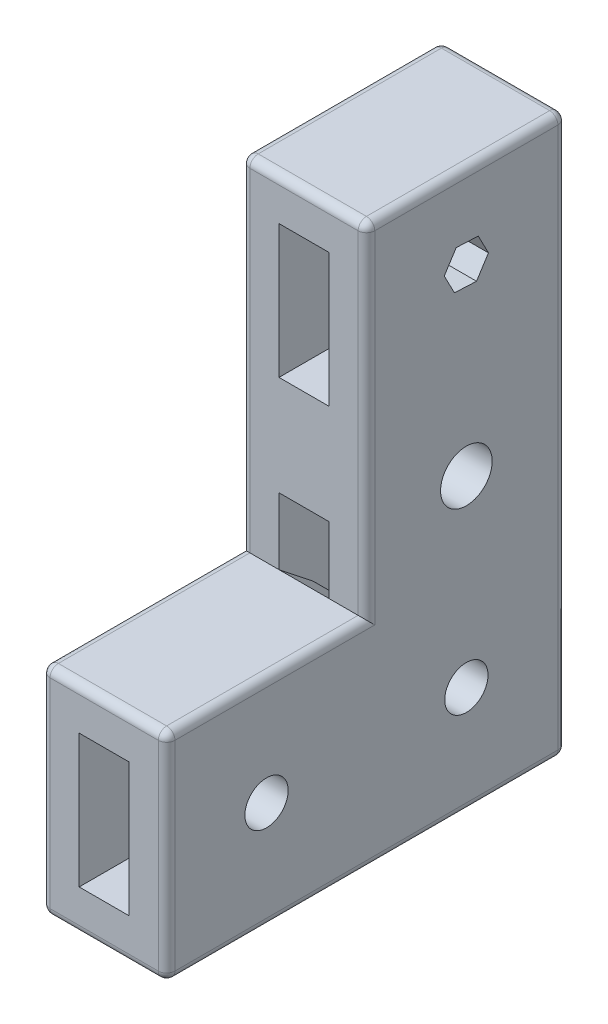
ISO-10303-21;
HEADER;
FILE_DESCRIPTION(('STEP AP214'),'2;1');
FILE_NAME('part.step','',(''),(''),'','','');
FILE_SCHEMA(('AUTOMOTIVE_DESIGN { 1 0 10303 214 1 1 1 1 }'));
ENDSEC;
DATA;
#1=APPLICATION_CONTEXT('core data for automotive mechanical design processes');
#2=APPLICATION_PROTOCOL_DEFINITION('international standard','automotive_design',2000,#1);
#3=PRODUCT_CONTEXT('',#1,'mechanical');
#4=PRODUCT('Part','Part','',(#3));
#5=PRODUCT_RELATED_PRODUCT_CATEGORY('part','',(#4));
#6=PRODUCT_DEFINITION_FORMATION('','',#4);
#7=PRODUCT_DEFINITION_CONTEXT('part definition',#1,'design');
#8=PRODUCT_DEFINITION('design','',#6,#7);
#9=PRODUCT_DEFINITION_SHAPE('','',#8);
#10=(LENGTH_UNIT() NAMED_UNIT(*) SI_UNIT(.MILLI.,.METRE.));
#11=(NAMED_UNIT(*) PLANE_ANGLE_UNIT() SI_UNIT($,.RADIAN.));
#12=(NAMED_UNIT(*) SI_UNIT($,.STERADIAN.) SOLID_ANGLE_UNIT());
#13=UNCERTAINTY_MEASURE_WITH_UNIT(LENGTH_MEASURE(1.E-05),#10,'distance_accuracy_value','');
#14=(GEOMETRIC_REPRESENTATION_CONTEXT(3) GLOBAL_UNCERTAINTY_ASSIGNED_CONTEXT((#13)) GLOBAL_UNIT_ASSIGNED_CONTEXT((#10,
#11,#12)) REPRESENTATION_CONTEXT('',''));
#15=CARTESIAN_POINT('',(0.,0.,0.));
#16=DIRECTION('',(0.,0.,1.));
#17=DIRECTION('',(1.,0.,0.));
#18=AXIS2_PLACEMENT_3D('',#15,#16,#17);
#19=CARTESIAN_POINT('',(15.,-35.2118959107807,-18.6468401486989));
#20=DIRECTION('',(0.,0.,1.));
#21=DIRECTION('',(1.,0.,0.));
#22=AXIS2_PLACEMENT_3D('',#19,#20,#21);
#23=PLANE('',#22);
#24=DIRECTION('',(-1.,0.,0.));
#25=VECTOR('',#24,1.);
#26=CARTESIAN_POINT('',(15.,-34.2118959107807,-18.6468401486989));
#27=LINE('',#26,#25);
#28=CARTESIAN_POINT('',(14.,-34.2118959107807,-18.6468401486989));
#29=VERTEX_POINT('',#28);
#30=CARTESIAN_POINT('',(1.,-34.2118959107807,-18.6468401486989));
#31=VERTEX_POINT('',#30);
#32=EDGE_CURVE('E450',#29,#31,#27,.T.);
#33=ORIENTED_EDGE('',*,*,#32,.T.);
#34=DIRECTION('',(0.,1.,0.));
#35=VECTOR('',#34,1.);
#36=CARTESIAN_POINT('',(1.,-35.2118959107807,-18.6468401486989));
#37=LINE('',#36,#35);
#38=CARTESIAN_POINT('',(1.,30.7881040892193,-18.6468401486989));
#39=VERTEX_POINT('',#38);
#40=EDGE_CURVE('E455',#31,#39,#37,.T.);
#41=ORIENTED_EDGE('',*,*,#40,.T.);
#42=DIRECTION('',(-1.,0.,0.));
#43=VECTOR('',#42,1.);
#44=CARTESIAN_POINT('',(15.,30.7881040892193,-18.6468401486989));
#45=LINE('',#44,#43);
#46=CARTESIAN_POINT('',(14.,30.7881040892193,-18.6468401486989));
#47=VERTEX_POINT('',#46);
#48=EDGE_CURVE('E452',#39,#47,#45,.F.);
#49=ORIENTED_EDGE('',*,*,#48,.T.);
#50=DIRECTION('',(0.,1.,0.));
#51=VECTOR('',#50,1.);
#52=CARTESIAN_POINT('',(14.,-35.2118959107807,-18.6468401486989));
#53=LINE('',#52,#51);
#54=EDGE_CURVE('E446',#47,#29,#53,.F.);
#55=ORIENTED_EDGE('',*,*,#54,.T.);
#56=EDGE_LOOP('',(#33,#41,#49,#55));
#57=FACE_BOUND('',#56,.T.);
#58=DIRECTION('',(-1.,0.,0.));
#59=VECTOR('',#58,1.);
#60=CARTESIAN_POINT('',(4.5,10.7881040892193,-18.6468401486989));
#61=LINE('',#60,#59);
#62=CARTESIAN_POINT('',(10.5,10.7881040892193,-18.6468401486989));
#63=VERTEX_POINT('',#62);
#64=CARTESIAN_POINT('',(4.5,10.7881040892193,-18.6468401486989));
#65=VERTEX_POINT('',#64);
#66=EDGE_CURVE('E382',#63,#65,#61,.T.);
#67=ORIENTED_EDGE('',*,*,#66,.F.);
#68=DIRECTION('',(0.,-1.,0.));
#69=VECTOR('',#68,1.);
#70=CARTESIAN_POINT('',(10.5,10.7881040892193,-18.6468401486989));
#71=LINE('',#70,#69);
#72=CARTESIAN_POINT('',(10.5,26.7881040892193,-18.6468401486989));
#73=VERTEX_POINT('',#72);
#74=EDGE_CURVE('E353',#73,#63,#71,.T.);
#75=ORIENTED_EDGE('',*,*,#74,.F.);
#76=DIRECTION('',(1.,0.,0.));
#77=VECTOR('',#76,1.);
#78=CARTESIAN_POINT('',(4.5,26.7881040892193,-18.6468401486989));
#79=LINE('',#78,#77);
#80=CARTESIAN_POINT('',(4.5,26.7881040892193,-18.6468401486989));
#81=VERTEX_POINT('',#80);
#82=EDGE_CURVE('E367',#81,#73,#79,.T.);
#83=ORIENTED_EDGE('',*,*,#82,.F.);
#84=DIRECTION('',(0.,1.,0.));
#85=VECTOR('',#84,1.);
#86=CARTESIAN_POINT('',(4.5,10.7881040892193,-18.6468401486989));
#87=LINE('',#86,#85);
#88=EDGE_CURVE('E377',#65,#81,#87,.T.);
#89=ORIENTED_EDGE('',*,*,#88,.F.);
#90=EDGE_LOOP('',(#67,#75,#83,#89));
#91=FACE_BOUND('',#90,.T.);
#92=DIRECTION('',(-1.,0.,0.));
#93=VECTOR('',#92,1.);
#94=CARTESIAN_POINT('',(4.5,-30.2118959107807,-18.6468401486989));
#95=LINE('',#94,#93);
#96=CARTESIAN_POINT('',(10.5,-30.2118959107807,-18.6468401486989));
#97=VERTEX_POINT('',#96);
#98=CARTESIAN_POINT('',(4.5,-30.2118959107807,-18.6468401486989));
#99=VERTEX_POINT('',#98);
#100=EDGE_CURVE('E348',#97,#99,#95,.T.);
#101=ORIENTED_EDGE('',*,*,#100,.F.);
#102=DIRECTION('',(0.,-1.,0.));
#103=VECTOR('',#102,1.);
#104=CARTESIAN_POINT('',(10.5,-28.2118959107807,-18.6468401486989));
#105=LINE('',#104,#103);
#106=CARTESIAN_POINT('',(10.5,-14.2118959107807,-18.6468401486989));
#107=VERTEX_POINT('',#106);
#108=EDGE_CURVE('E326',#107,#97,#105,.T.);
#109=ORIENTED_EDGE('',*,*,#108,.F.);
#110=DIRECTION('',(1.,0.,0.));
#111=VECTOR('',#110,1.);
#112=CARTESIAN_POINT('',(4.5,-14.2118959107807,-18.6468401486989));
#113=LINE('',#112,#111);
#114=CARTESIAN_POINT('',(4.5,-14.2118959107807,-18.6468401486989));
#115=VERTEX_POINT('',#114);
#116=EDGE_CURVE('E349',#115,#107,#113,.T.);
#117=ORIENTED_EDGE('',*,*,#116,.F.);
#118=DIRECTION('',(0.,1.,0.));
#119=VECTOR('',#118,1.);
#120=CARTESIAN_POINT('',(4.5,-28.2118959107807,-18.6468401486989));
#121=LINE('',#120,#119);
#122=EDGE_CURVE('E438',#99,#115,#121,.T.);
#123=ORIENTED_EDGE('',*,*,#122,.F.);
#124=EDGE_LOOP('',(#101,#109,#117,#123));
#125=FACE_BOUND('',#124,.T.);
#126=ADVANCED_FACE('F51',(#57,#91,#125),#23,.F.);
#127=CARTESIAN_POINT('',(0.,21.6655629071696,-9.29982280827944));
#128=DIRECTION('',(0.,0.459508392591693,-0.888173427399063));
#129=DIRECTION('',(0.,0.888173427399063,0.459508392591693));
#130=AXIS2_PLACEMENT_3D('',#127,#128,#129);
#131=PLANE('',#130);
#132=DIRECTION('',(1.,0.,0.));
#133=VECTOR('',#132,1.);
#134=CARTESIAN_POINT('',(0.,24.0243838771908,-8.079455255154));
#135=LINE('',#134,#133);
#136=CARTESIAN_POINT('',(10.5,24.0243838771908,-8.079455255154));
#137=VERTEX_POINT('',#136);
#138=CARTESIAN_POINT('',(15.,24.0243838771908,-8.079455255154));
#139=VERTEX_POINT('',#138);
#140=EDGE_CURVE('E1417',#137,#139,#135,.T.);
#141=ORIENTED_EDGE('',*,*,#140,.F.);
#142=DIRECTION('',(0.,-0.888173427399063,-0.459508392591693));
#143=VECTOR('',#142,1.);
#144=CARTESIAN_POINT('',(10.5,21.6655629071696,-9.29982280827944));
#145=LINE('',#144,#143);
#146=CARTESIAN_POINT('',(10.5,21.6655629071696,-9.29982280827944));
#147=VERTEX_POINT('',#146);
#148=EDGE_CURVE('E422',#137,#147,#145,.T.);
#149=ORIENTED_EDGE('',*,*,#148,.T.);
#150=DIRECTION('',(1.,0.,0.));
#151=VECTOR('',#150,1.);
#152=CARTESIAN_POINT('',(0.,21.6655629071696,-9.29982280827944));
#153=LINE('',#152,#151);
#154=CARTESIAN_POINT('',(15.,21.6655629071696,-9.29982280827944));
#155=VERTEX_POINT('',#154);
#156=EDGE_CURVE('E822',#147,#155,#153,.T.);
#157=ORIENTED_EDGE('',*,*,#156,.T.);
#158=DIRECTION('',(0.,0.888173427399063,0.459508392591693));
#159=VECTOR('',#158,1.);
#160=CARTESIAN_POINT('',(15.,21.6655629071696,-9.29982280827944));
#161=LINE('',#160,#159);
#162=EDGE_CURVE('E1385',#155,#139,#161,.T.);
#163=ORIENTED_EDGE('',*,*,#162,.T.);
#164=EDGE_LOOP('',(#141,#149,#157,#163));
#165=FACE_BOUND('',#164,.T.);
#166=ADVANCED_FACE('F526',(#165),#131,.F.);
#167=CARTESIAN_POINT('',(0.,19.4292831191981,-7.86720770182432));
#168=DIRECTION('',(0.,-0.539426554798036,-0.842032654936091));
#169=DIRECTION('',(0.,0.842032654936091,-0.539426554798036));
#170=AXIS2_PLACEMENT_3D('',#167,#168,#169);
#171=PLANE('',#170);
#172=ORIENTED_EDGE('',*,*,#156,.F.);
#173=DIRECTION('',(0.,-0.842032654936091,0.539426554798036));
#174=VECTOR('',#173,1.);
#175=CARTESIAN_POINT('',(10.5,19.4292831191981,-7.86720770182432));
#176=LINE('',#175,#174);
#177=CARTESIAN_POINT('',(10.5,19.4292831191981,-7.86720770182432));
#178=VERTEX_POINT('',#177);
#179=EDGE_CURVE('E416',#147,#178,#176,.T.);
#180=ORIENTED_EDGE('',*,*,#179,.T.);
#181=DIRECTION('',(1.,0.,0.));
#182=VECTOR('',#181,1.);
#183=CARTESIAN_POINT('',(0.,19.4292831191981,-7.86720770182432));
#184=LINE('',#183,#182);
#185=CARTESIAN_POINT('',(15.,19.4292831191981,-7.86720770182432));
#186=VERTEX_POINT('',#185);
#187=EDGE_CURVE('E1364',#178,#186,#184,.T.);
#188=ORIENTED_EDGE('',*,*,#187,.T.);
#189=DIRECTION('',(0.,0.842032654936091,-0.539426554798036));
#190=VECTOR('',#189,1.);
#191=CARTESIAN_POINT('',(15.,19.4292831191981,-7.86720770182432));
#192=LINE('',#191,#190);
#193=EDGE_CURVE('E1370',#186,#155,#192,.T.);
#194=ORIENTED_EDGE('',*,*,#193,.T.);
#195=EDGE_LOOP('',(#172,#180,#188,#194));
#196=FACE_BOUND('',#195,.T.);
#197=ADVANCED_FACE('F1328',(#196),#171,.F.);
#198=CARTESIAN_POINT('',(0.,19.5518243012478,-5.21422504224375));
#199=DIRECTION('',(0.,-0.998934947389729,0.0461407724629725));
#200=DIRECTION('',(0.,-0.0461407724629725,-0.998934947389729));
#201=AXIS2_PLACEMENT_3D('',#198,#199,#200);
#202=PLANE('',#201);
#203=ORIENTED_EDGE('',*,*,#187,.F.);
#204=DIRECTION('',(0.,0.0461407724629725,0.998934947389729));
#205=VECTOR('',#204,1.);
#206=CARTESIAN_POINT('',(10.5,19.5518243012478,-5.21422504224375));
#207=LINE('',#206,#205);
#208=CARTESIAN_POINT('',(10.5,19.5518243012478,-5.21422504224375));
#209=VERTEX_POINT('',#208);
#210=EDGE_CURVE('E417',#178,#209,#207,.T.);
#211=ORIENTED_EDGE('',*,*,#210,.T.);
#212=DIRECTION('',(1.,0.,0.));
#213=VECTOR('',#212,1.);
#214=CARTESIAN_POINT('',(0.,19.5518243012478,-5.21422504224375));
#215=LINE('',#214,#213);
#216=CARTESIAN_POINT('',(15.,19.5518243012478,-5.21422504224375));
#217=VERTEX_POINT('',#216);
#218=EDGE_CURVE('E1402',#209,#217,#215,.T.);
#219=ORIENTED_EDGE('',*,*,#218,.T.);
#220=DIRECTION('',(0.,-0.0461407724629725,-0.998934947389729));
#221=VECTOR('',#220,1.);
#222=CARTESIAN_POINT('',(15.,19.5518243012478,-5.21422504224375));
#223=LINE('',#222,#221);
#224=EDGE_CURVE('E1372',#217,#186,#223,.T.);
#225=ORIENTED_EDGE('',*,*,#224,.T.);
#226=EDGE_LOOP('',(#203,#211,#219,#225));
#227=FACE_BOUND('',#226,.T.);
#228=ADVANCED_FACE('F1318',(#227),#202,.F.);
#229=CARTESIAN_POINT('',(0.,21.9106452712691,-3.9938574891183));
#230=DIRECTION('',(0.,-0.459508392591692,0.888173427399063));
#231=DIRECTION('',(0.,-0.888173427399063,-0.459508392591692));
#232=AXIS2_PLACEMENT_3D('',#229,#230,#231);
#233=PLANE('',#232);
#234=ORIENTED_EDGE('',*,*,#218,.F.);
#235=DIRECTION('',(0.,0.888173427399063,0.459508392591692));
#236=VECTOR('',#235,1.);
#237=CARTESIAN_POINT('',(10.5,21.9106452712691,-3.99385748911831));
#238=LINE('',#237,#236);
#239=CARTESIAN_POINT('',(10.5,21.9106452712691,-3.9938574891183));
#240=VERTEX_POINT('',#239);
#241=EDGE_CURVE('E415',#209,#240,#238,.T.);
#242=ORIENTED_EDGE('',*,*,#241,.T.);
#243=DIRECTION('',(1.,0.,0.));
#244=VECTOR('',#243,1.);
#245=CARTESIAN_POINT('',(0.,21.9106452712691,-3.9938574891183));
#246=LINE('',#245,#244);
#247=CARTESIAN_POINT('',(15.,21.9106452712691,-3.9938574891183));
#248=VERTEX_POINT('',#247);
#249=EDGE_CURVE('E1407',#240,#248,#246,.T.);
#250=ORIENTED_EDGE('',*,*,#249,.T.);
#251=DIRECTION('',(0.,-0.888173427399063,-0.459508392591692));
#252=VECTOR('',#251,1.);
#253=CARTESIAN_POINT('',(15.,21.9106452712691,-3.9938574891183));
#254=LINE('',#253,#252);
#255=EDGE_CURVE('E1371',#248,#217,#254,.T.);
#256=ORIENTED_EDGE('',*,*,#255,.T.);
#257=EDGE_LOOP('',(#234,#242,#250,#256));
#258=FACE_BOUND('',#257,.T.);
#259=ADVANCED_FACE('F1308',(#258),#233,.F.);
#260=CARTESIAN_POINT('',(0.,24.1469250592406,-5.42647259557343));
#261=DIRECTION('',(0.,0.539426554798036,0.84203265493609));
#262=DIRECTION('',(0.,-0.842032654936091,0.539426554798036));
#263=AXIS2_PLACEMENT_3D('',#260,#261,#262);
#264=PLANE('',#263);
#265=ORIENTED_EDGE('',*,*,#249,.F.);
#266=DIRECTION('',(0.,0.842032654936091,-0.539426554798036));
#267=VECTOR('',#266,1.);
#268=CARTESIAN_POINT('',(10.5,24.1469250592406,-5.42647259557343));
#269=LINE('',#268,#267);
#270=CARTESIAN_POINT('',(10.5,24.1469250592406,-5.42647259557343));
#271=VERTEX_POINT('',#270);
#272=EDGE_CURVE('E408',#240,#271,#269,.T.);
#273=ORIENTED_EDGE('',*,*,#272,.T.);
#274=DIRECTION('',(1.,0.,0.));
#275=VECTOR('',#274,1.);
#276=CARTESIAN_POINT('',(0.,24.1469250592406,-5.42647259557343));
#277=LINE('',#276,#275);
#278=CARTESIAN_POINT('',(15.,24.1469250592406,-5.42647259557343));
#279=VERTEX_POINT('',#278);
#280=EDGE_CURVE('E1412',#271,#279,#277,.T.);
#281=ORIENTED_EDGE('',*,*,#280,.T.);
#282=DIRECTION('',(0.,-0.84203265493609,0.539426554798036));
#283=VECTOR('',#282,1.);
#284=CARTESIAN_POINT('',(15.,24.1469250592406,-5.42647259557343));
#285=LINE('',#284,#283);
#286=EDGE_CURVE('E1380',#279,#248,#285,.T.);
#287=ORIENTED_EDGE('',*,*,#286,.T.);
#288=EDGE_LOOP('',(#265,#273,#281,#287));
#289=FACE_BOUND('',#288,.T.);
#290=ADVANCED_FACE('F1298',(#289),#264,.F.);
#291=CARTESIAN_POINT('',(0.,24.0243838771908,-8.079455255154));
#292=DIRECTION('',(0.,0.998934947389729,-0.0461407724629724));
#293=DIRECTION('',(0.,0.0461407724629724,0.998934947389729));
#294=AXIS2_PLACEMENT_3D('',#291,#292,#293);
#295=PLANE('',#294);
#296=ORIENTED_EDGE('',*,*,#280,.F.);
#297=DIRECTION('',(0.,-0.0461407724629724,-0.998934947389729));
#298=VECTOR('',#297,1.);
#299=CARTESIAN_POINT('',(10.5,24.0243838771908,-8.079455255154));
#300=LINE('',#299,#298);
#301=EDGE_CURVE('E894',#271,#137,#300,.T.);
#302=ORIENTED_EDGE('',*,*,#301,.T.);
#303=ORIENTED_EDGE('',*,*,#140,.T.);
#304=DIRECTION('',(0.,0.0461407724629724,0.998934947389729));
#305=VECTOR('',#304,1.);
#306=CARTESIAN_POINT('',(15.,24.0243838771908,-8.079455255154));
#307=LINE('',#306,#305);
#308=EDGE_CURVE('E1378',#139,#279,#307,.T.);
#309=ORIENTED_EDGE('',*,*,#308,.T.);
#310=EDGE_LOOP('',(#296,#302,#303,#309));
#311=FACE_BOUND('',#310,.T.);
#312=ADVANCED_FACE('F1292',(#311),#295,.F.);
#313=CARTESIAN_POINT('',(0.,-22.2118959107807,-6.64684014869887));
#314=DIRECTION('',(1.,0.,0.));
#315=DIRECTION('',(0.,0.,-1.));
#316=AXIS2_PLACEMENT_3D('',#313,#314,#315);
#317=CYLINDRICAL_SURFACE('',#316,2.6);
#318=CARTESIAN_POINT('',(10.5,-22.2118959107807,-6.64684014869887));
#319=DIRECTION('',(1.,0.,0.));
#320=DIRECTION('',(0.,1.,0.));
#321=AXIS2_PLACEMENT_3D('',#318,#319,#320);
#322=CIRCLE('',#321,2.6);
#323=CARTESIAN_POINT('',(10.5,-19.6118959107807,-6.64684014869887));
#324=VERTEX_POINT('',#323);
#325=EDGE_CURVE('E386',#324,#324,#322,.F.);
#326=ORIENTED_EDGE('',*,*,#325,.T.);
#327=EDGE_LOOP('',(#326));
#328=FACE_BOUND('',#327,.T.);
#329=CARTESIAN_POINT('',(15.,-22.2118959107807,-6.64684014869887));
#330=DIRECTION('',(1.,0.,0.));
#331=DIRECTION('',(0.,0.,-1.));
#332=AXIS2_PLACEMENT_3D('',#329,#330,#331);
#333=CIRCLE('',#332,2.6);
#334=CARTESIAN_POINT('',(15.,-22.2118959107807,-9.24684014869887));
#335=VERTEX_POINT('',#334);
#336=EDGE_CURVE('E1430',#335,#335,#333,.T.);
#337=ORIENTED_EDGE('',*,*,#336,.T.);
#338=EDGE_LOOP('',(#337));
#339=FACE_BOUND('',#338,.T.);
#340=ADVANCED_FACE('F1283',(#328,#339),#317,.F.);
#341=CARTESIAN_POINT('',(0.,-22.2118959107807,17.3531598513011));
#342=DIRECTION('',(1.,0.,0.));
#343=DIRECTION('',(0.,0.,-1.));
#344=AXIS2_PLACEMENT_3D('',#341,#342,#343);
#345=CYLINDRICAL_SURFACE('',#344,2.6);
#346=CARTESIAN_POINT('',(10.5,-22.2118959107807,17.3531598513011));
#347=DIRECTION('',(1.,0.,0.));
#348=DIRECTION('',(0.,1.,0.));
#349=AXIS2_PLACEMENT_3D('',#346,#347,#348);
#350=CIRCLE('',#349,2.6);
#351=CARTESIAN_POINT('',(10.5,-19.6118959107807,17.3531598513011));
#352=VERTEX_POINT('',#351);
#353=EDGE_CURVE('E390',#352,#352,#350,.F.);
#354=ORIENTED_EDGE('',*,*,#353,.T.);
#355=EDGE_LOOP('',(#354));
#356=FACE_BOUND('',#355,.T.);
#357=CARTESIAN_POINT('',(15.,-22.2118959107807,17.3531598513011));
#358=DIRECTION('',(1.,0.,0.));
#359=DIRECTION('',(0.,0.,-1.));
#360=AXIS2_PLACEMENT_3D('',#357,#358,#359);
#361=CIRCLE('',#360,2.6);
#362=CARTESIAN_POINT('',(15.,-22.2118959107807,14.7531598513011));
#363=VERTEX_POINT('',#362);
#364=EDGE_CURVE('E1432',#363,#363,#361,.T.);
#365=ORIENTED_EDGE('',*,*,#364,.T.);
#366=EDGE_LOOP('',(#365));
#367=FACE_BOUND('',#366,.T.);
#368=ADVANCED_FACE('F519',(#356,#367),#345,.F.);
#369=CARTESIAN_POINT('',(15.,31.7881040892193,5.35315985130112));
#370=DIRECTION('',(0.,0.,-1.));
#371=DIRECTION('',(0.,1.,0.));
#372=AXIS2_PLACEMENT_3D('',#369,#370,#371);
#373=PLANE('',#372);
#374=DIRECTION('',(1.,0.,0.));
#375=VECTOR('',#374,1.);
#376=CARTESIAN_POINT('',(15.,26.7881040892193,5.35315985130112));
#377=LINE('',#376,#375);
#378=CARTESIAN_POINT('',(4.5,26.7881040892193,5.35315985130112));
#379=VERTEX_POINT('',#378);
#380=CARTESIAN_POINT('',(10.5,26.7881040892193,5.35315985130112));
#381=VERTEX_POINT('',#380);
#382=EDGE_CURVE('E902',#379,#381,#377,.T.);
#383=ORIENTED_EDGE('',*,*,#382,.T.);
#384=DIRECTION('',(0.,-1.,0.));
#385=VECTOR('',#384,1.);
#386=CARTESIAN_POINT('',(10.5,31.7881040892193,5.35315985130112));
#387=LINE('',#386,#385);
#388=CARTESIAN_POINT('',(10.5,10.7881040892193,5.35315985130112));
#389=VERTEX_POINT('',#388);
#390=EDGE_CURVE('E424',#381,#389,#387,.T.);
#391=ORIENTED_EDGE('',*,*,#390,.T.);
#392=DIRECTION('',(-1.,0.,0.));
#393=VECTOR('',#392,1.);
#394=CARTESIAN_POINT('',(15.,10.7881040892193,5.35315985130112));
#395=LINE('',#394,#393);
#396=CARTESIAN_POINT('',(4.5,10.7881040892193,5.35315985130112));
#397=VERTEX_POINT('',#396);
#398=EDGE_CURVE('E897',#389,#397,#395,.T.);
#399=ORIENTED_EDGE('',*,*,#398,.T.);
#400=DIRECTION('',(0.,1.,0.));
#401=VECTOR('',#400,1.);
#402=CARTESIAN_POINT('',(4.5,31.7881040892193,5.35315985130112));
#403=LINE('',#402,#401);
#404=EDGE_CURVE('E409',#397,#379,#403,.T.);
#405=ORIENTED_EDGE('',*,*,#404,.T.);
#406=EDGE_LOOP('',(#383,#391,#399,#405));
#407=FACE_BOUND('',#406,.T.);
#408=DIRECTION('',(-1.,0.,0.));
#409=VECTOR('',#408,1.);
#410=CARTESIAN_POINT('',(15.,-9.21189591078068,5.35315985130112));
#411=LINE('',#410,#409);
#412=CARTESIAN_POINT('',(14.,-9.21189591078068,5.35315985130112));
#413=VERTEX_POINT('',#412);
#414=CARTESIAN_POINT('',(10.5,-9.21189591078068,5.35315985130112));
#415=VERTEX_POINT('',#414);
#416=EDGE_CURVE('E476',#413,#415,#411,.T.);
#417=ORIENTED_EDGE('',*,*,#416,.F.);
#418=DIRECTION('',(0.,-1.,0.));
#419=VECTOR('',#418,1.);
#420=CARTESIAN_POINT('',(14.,31.7881040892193,5.35315985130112));
#421=LINE('',#420,#419);
#422=CARTESIAN_POINT('',(14.,30.7881040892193,5.35315985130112));
#423=VERTEX_POINT('',#422);
#424=EDGE_CURVE('E672',#413,#423,#421,.F.);
#425=ORIENTED_EDGE('',*,*,#424,.T.);
#426=DIRECTION('',(-1.,0.,0.));
#427=VECTOR('',#426,1.);
#428=CARTESIAN_POINT('',(15.,30.7881040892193,5.35315985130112));
#429=LINE('',#428,#427);
#430=CARTESIAN_POINT('',(1.,30.7881040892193,5.35315985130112));
#431=VERTEX_POINT('',#430);
#432=EDGE_CURVE('E671',#423,#431,#429,.T.);
#433=ORIENTED_EDGE('',*,*,#432,.T.);
#434=DIRECTION('',(0.,-1.,0.));
#435=VECTOR('',#434,1.);
#436=CARTESIAN_POINT('',(1.,31.7881040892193,5.35315985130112));
#437=LINE('',#436,#435);
#438=CARTESIAN_POINT('',(1.,-9.21189591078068,5.35315985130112));
#439=VERTEX_POINT('',#438);
#440=EDGE_CURVE('E480',#431,#439,#437,.T.);
#441=ORIENTED_EDGE('',*,*,#440,.T.);
#442=CARTESIAN_POINT('',(4.5,-9.21189591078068,5.35315985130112));
#443=VERTEX_POINT('',#442);
#444=EDGE_CURVE('E485',#443,#439,#411,.T.);
#445=ORIENTED_EDGE('',*,*,#444,.F.);
#446=DIRECTION('',(0.,-1.,0.));
#447=VECTOR('',#446,1.);
#448=CARTESIAN_POINT('',(4.5,-9.21189591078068,5.35315985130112));
#449=LINE('',#448,#447);
#450=CARTESIAN_POINT('',(4.5,-1.21189591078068,5.35315985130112));
#451=VERTEX_POINT('',#450);
#452=EDGE_CURVE('E881',#451,#443,#449,.T.);
#453=ORIENTED_EDGE('',*,*,#452,.F.);
#454=DIRECTION('',(-1.,0.,0.));
#455=VECTOR('',#454,1.);
#456=CARTESIAN_POINT('',(4.5,-1.21189591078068,5.35315985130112));
#457=LINE('',#456,#455);
#458=CARTESIAN_POINT('',(10.5,-1.21189591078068,5.35315985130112));
#459=VERTEX_POINT('',#458);
#460=EDGE_CURVE('E499',#459,#451,#457,.T.);
#461=ORIENTED_EDGE('',*,*,#460,.F.);
#462=DIRECTION('',(0.,1.,0.));
#463=VECTOR('',#462,1.);
#464=CARTESIAN_POINT('',(10.5,-9.21189591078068,5.35315985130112));
#465=LINE('',#464,#463);
#466=EDGE_CURVE('E811',#415,#459,#465,.T.);
#467=ORIENTED_EDGE('',*,*,#466,.F.);
#468=EDGE_LOOP('',(#417,#425,#433,#441,#445,#453,#461,#467));
#469=FACE_BOUND('',#468,.T.);
#470=ADVANCED_FACE('F510',(#407,#469),#373,.F.);
#471=CARTESIAN_POINT('',(15.,-9.21189591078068,29.3531598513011));
#472=DIRECTION('',(0.,0.,-1.));
#473=DIRECTION('',(-1.,0.,0.));
#474=AXIS2_PLACEMENT_3D('',#471,#472,#473);
#475=PLANE('',#474);
#476=DIRECTION('',(-1.,0.,0.));
#477=VECTOR('',#476,1.);
#478=CARTESIAN_POINT('',(15.,-34.2118959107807,29.3531598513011));
#479=LINE('',#478,#477);
#480=CARTESIAN_POINT('',(1.,-34.2118959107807,29.3531598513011));
#481=VERTEX_POINT('',#480);
#482=CARTESIAN_POINT('',(14.,-34.2118959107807,29.3531598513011));
#483=VERTEX_POINT('',#482);
#484=EDGE_CURVE('E58',#481,#483,#479,.F.);
#485=ORIENTED_EDGE('',*,*,#484,.T.);
#486=DIRECTION('',(0.,-1.,0.));
#487=VECTOR('',#486,1.);
#488=CARTESIAN_POINT('',(14.,-9.21189591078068,29.3531598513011));
#489=LINE('',#488,#487);
#490=CARTESIAN_POINT('',(14.,-10.2118959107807,29.3531598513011));
#491=VERTEX_POINT('',#490);
#492=EDGE_CURVE('E12',#483,#491,#489,.F.);
#493=ORIENTED_EDGE('',*,*,#492,.T.);
#494=DIRECTION('',(-1.,0.,0.));
#495=VECTOR('',#494,1.);
#496=CARTESIAN_POINT('',(15.,-10.2118959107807,29.3531598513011));
#497=LINE('',#496,#495);
#498=CARTESIAN_POINT('',(1.,-10.2118959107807,29.3531598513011));
#499=VERTEX_POINT('',#498);
#500=EDGE_CURVE('E697',#491,#499,#497,.T.);
#501=ORIENTED_EDGE('',*,*,#500,.T.);
#502=DIRECTION('',(0.,-1.,0.));
#503=VECTOR('',#502,1.);
#504=CARTESIAN_POINT('',(1.,-9.21189591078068,29.3531598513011));
#505=LINE('',#504,#503);
#506=EDGE_CURVE('E72',#499,#481,#505,.T.);
#507=ORIENTED_EDGE('',*,*,#506,.T.);
#508=EDGE_LOOP('',(#485,#493,#501,#507));
#509=FACE_BOUND('',#508,.T.);
#510=DIRECTION('',(1.,0.,0.));
#511=VECTOR('',#510,1.);
#512=CARTESIAN_POINT('',(4.5,-14.2118959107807,29.3531598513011));
#513=LINE('',#512,#511);
#514=CARTESIAN_POINT('',(4.5,-14.2118959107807,29.3531598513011));
#515=VERTEX_POINT('',#514);
#516=CARTESIAN_POINT('',(10.5,-14.2118959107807,29.3531598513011));
#517=VERTEX_POINT('',#516);
#518=EDGE_CURVE('E331',#515,#517,#513,.T.);
#519=ORIENTED_EDGE('',*,*,#518,.T.);
#520=DIRECTION('',(0.,-1.,0.));
#521=VECTOR('',#520,1.);
#522=CARTESIAN_POINT('',(10.5,-30.2118959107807,29.3531598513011));
#523=LINE('',#522,#521);
#524=CARTESIAN_POINT('',(10.5,-30.2118959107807,29.3531598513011));
#525=VERTEX_POINT('',#524);
#526=EDGE_CURVE('E327',#517,#525,#523,.T.);
#527=ORIENTED_EDGE('',*,*,#526,.T.);
#528=DIRECTION('',(-1.,0.,0.));
#529=VECTOR('',#528,1.);
#530=CARTESIAN_POINT('',(4.5,-30.2118959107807,29.3531598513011));
#531=LINE('',#530,#529);
#532=CARTESIAN_POINT('',(4.5,-30.2118959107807,29.3531598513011));
#533=VERTEX_POINT('',#532);
#534=EDGE_CURVE('E336',#525,#533,#531,.T.);
#535=ORIENTED_EDGE('',*,*,#534,.T.);
#536=DIRECTION('',(0.,1.,0.));
#537=VECTOR('',#536,1.);
#538=CARTESIAN_POINT('',(4.5,-30.2118959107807,29.3531598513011));
#539=LINE('',#538,#537);
#540=EDGE_CURVE('E345',#533,#515,#539,.T.);
#541=ORIENTED_EDGE('',*,*,#540,.T.);
#542=EDGE_LOOP('',(#519,#527,#535,#541));
#543=FACE_BOUND('',#542,.T.);
#544=ADVANCED_FACE('F343',(#509,#543),#475,.F.);
#545=CARTESIAN_POINT('',(15.,-35.2118959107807,29.3531598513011));
#546=DIRECTION('',(0.,1.,0.));
#547=DIRECTION('',(0.,0.,1.));
#548=AXIS2_PLACEMENT_3D('',#545,#546,#547);
#549=PLANE('',#548);
#550=DIRECTION('',(0.,0.,-1.));
#551=VECTOR('',#550,1.);
#552=CARTESIAN_POINT('',(1.,-35.2118959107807,29.3531598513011));
#553=LINE('',#552,#551);
#554=CARTESIAN_POINT('',(1.,-35.2118959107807,28.3531598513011));
#555=VERTEX_POINT('',#554);
#556=CARTESIAN_POINT('',(1.,-35.2118959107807,-17.6468401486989));
#557=VERTEX_POINT('',#556);
#558=EDGE_CURVE('E695',#555,#557,#553,.T.);
#559=ORIENTED_EDGE('',*,*,#558,.T.);
#560=DIRECTION('',(-1.,0.,0.));
#561=VECTOR('',#560,1.);
#562=CARTESIAN_POINT('',(15.,-35.2118959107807,-17.6468401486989));
#563=LINE('',#562,#561);
#564=CARTESIAN_POINT('',(14.,-35.2118959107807,-17.6468401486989));
#565=VERTEX_POINT('',#564);
#566=EDGE_CURVE('E696',#557,#565,#563,.F.);
#567=ORIENTED_EDGE('',*,*,#566,.T.);
#568=DIRECTION('',(0.,0.,-1.));
#569=VECTOR('',#568,1.);
#570=CARTESIAN_POINT('',(14.,-35.2118959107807,29.3531598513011));
#571=LINE('',#570,#569);
#572=CARTESIAN_POINT('',(14.,-35.2118959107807,28.3531598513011));
#573=VERTEX_POINT('',#572);
#574=EDGE_CURVE('E692',#565,#573,#571,.F.);
#575=ORIENTED_EDGE('',*,*,#574,.T.);
#576=DIRECTION('',(-1.,0.,0.));
#577=VECTOR('',#576,1.);
#578=CARTESIAN_POINT('',(15.,-35.2118959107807,28.3531598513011));
#579=LINE('',#578,#577);
#580=EDGE_CURVE('E687',#573,#555,#579,.T.);
#581=ORIENTED_EDGE('',*,*,#580,.T.);
#582=EDGE_LOOP('',(#559,#567,#575,#581));
#583=FACE_BOUND('',#582,.T.);
#584=ADVANCED_FACE('F523',(#583),#549,.F.);
#585=CARTESIAN_POINT('',(15.,31.7881040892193,-18.6468401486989));
#586=DIRECTION('',(0.,-1.,0.));
#587=DIRECTION('',(0.,0.,-1.));
#588=AXIS2_PLACEMENT_3D('',#585,#586,#587);
#589=PLANE('',#588);
#590=DIRECTION('',(0.,0.,1.));
#591=VECTOR('',#590,1.);
#592=CARTESIAN_POINT('',(14.,31.7881040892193,-18.6468401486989));
#593=LINE('',#592,#591);
#594=CARTESIAN_POINT('',(14.,31.7881040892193,4.35315985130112));
#595=VERTEX_POINT('',#594);
#596=CARTESIAN_POINT('',(14.,31.7881040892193,-17.6468401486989));
#597=VERTEX_POINT('',#596);
#598=EDGE_CURVE('E469',#595,#597,#593,.F.);
#599=ORIENTED_EDGE('',*,*,#598,.T.);
#600=DIRECTION('',(-1.,0.,0.));
#601=VECTOR('',#600,1.);
#602=CARTESIAN_POINT('',(15.,31.7881040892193,-17.6468401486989));
#603=LINE('',#602,#601);
#604=CARTESIAN_POINT('',(1.,31.7881040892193,-17.6468401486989));
#605=VERTEX_POINT('',#604);
#606=EDGE_CURVE('E473',#597,#605,#603,.T.);
#607=ORIENTED_EDGE('',*,*,#606,.T.);
#608=DIRECTION('',(0.,0.,1.));
#609=VECTOR('',#608,1.);
#610=CARTESIAN_POINT('',(1.,31.7881040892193,-18.6468401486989));
#611=LINE('',#610,#609);
#612=CARTESIAN_POINT('',(1.,31.7881040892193,4.35315985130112));
#613=VERTEX_POINT('',#612);
#614=EDGE_CURVE('E475',#605,#613,#611,.T.);
#615=ORIENTED_EDGE('',*,*,#614,.T.);
#616=DIRECTION('',(-1.,0.,0.));
#617=VECTOR('',#616,1.);
#618=CARTESIAN_POINT('',(15.,31.7881040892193,4.35315985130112));
#619=LINE('',#618,#617);
#620=EDGE_CURVE('E472',#613,#595,#619,.F.);
#621=ORIENTED_EDGE('',*,*,#620,.T.);
#622=EDGE_LOOP('',(#599,#607,#615,#621));
#623=FACE_BOUND('',#622,.T.);
#624=ADVANCED_FACE('F524',(#623),#589,.F.);
#625=CARTESIAN_POINT('',(15.,-9.21189591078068,5.35315985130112));
#626=DIRECTION('',(0.,-1.,0.));
#627=DIRECTION('',(0.,0.,-1.));
#628=AXIS2_PLACEMENT_3D('',#625,#626,#627);
#629=PLANE('',#628);
#630=DIRECTION('',(-1.,0.,0.));
#631=VECTOR('',#630,1.);
#632=CARTESIAN_POINT('',(15.,-9.21189591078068,28.3531598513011));
#633=LINE('',#632,#631);
#634=CARTESIAN_POINT('',(1.,-9.21189591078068,28.3531598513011));
#635=VERTEX_POINT('',#634);
#636=CARTESIAN_POINT('',(14.,-9.21189591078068,28.3531598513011));
#637=VERTEX_POINT('',#636);
#638=EDGE_CURVE('E684',#635,#637,#633,.F.);
#639=ORIENTED_EDGE('',*,*,#638,.T.);
#640=DIRECTION('',(0.,0.,1.));
#641=VECTOR('',#640,1.);
#642=CARTESIAN_POINT('',(14.,-9.21189591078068,5.35315985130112));
#643=LINE('',#642,#641);
#644=EDGE_CURVE('E653',#637,#413,#643,.F.);
#645=ORIENTED_EDGE('',*,*,#644,.T.);
#646=ORIENTED_EDGE('',*,*,#416,.T.);
#647=DIRECTION('',(1.,0.,0.));
#648=VECTOR('',#647,1.);
#649=CARTESIAN_POINT('',(4.5,-9.21189591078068,5.35315985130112));
#650=LINE('',#649,#648);
#651=EDGE_CURVE('E818',#443,#415,#650,.T.);
#652=ORIENTED_EDGE('',*,*,#651,.F.);
#653=ORIENTED_EDGE('',*,*,#444,.T.);
#654=DIRECTION('',(0.,0.,1.));
#655=VECTOR('',#654,1.);
#656=CARTESIAN_POINT('',(1.,-9.21189591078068,5.35315985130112));
#657=LINE('',#656,#655);
#658=EDGE_CURVE('E690',#439,#635,#657,.T.);
#659=ORIENTED_EDGE('',*,*,#658,.T.);
#660=EDGE_LOOP('',(#639,#645,#646,#652,#653,#659));
#661=FACE_BOUND('',#660,.T.);
#662=ADVANCED_FACE('F516',(#661),#629,.F.);
#663=CARTESIAN_POINT('',(15.,0.,0.));
#664=DIRECTION('',(1.,0.,0.));
#665=DIRECTION('',(0.,0.,-1.));
#666=AXIS2_PLACEMENT_3D('',#663,#664,#665);
#667=PLANE('',#666);
#668=DIRECTION('',(0.,1.,0.));
#669=VECTOR('',#668,1.);
#670=CARTESIAN_POINT('',(15.,31.7881040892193,-17.6468401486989));
#671=LINE('',#670,#669);
#672=CARTESIAN_POINT('',(15.,-34.2118959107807,-17.6468401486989));
#673=VERTEX_POINT('',#672);
#674=CARTESIAN_POINT('',(15.,30.7881040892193,-17.6468401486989));
#675=VERTEX_POINT('',#674);
#676=EDGE_CURVE('E678',#673,#675,#671,.T.);
#677=ORIENTED_EDGE('',*,*,#676,.T.);
#678=DIRECTION('',(0.,0.,1.));
#679=VECTOR('',#678,1.);
#680=CARTESIAN_POINT('',(15.,30.7881040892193,5.35315985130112));
#681=LINE('',#680,#679);
#682=CARTESIAN_POINT('',(15.,30.7881040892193,4.35315985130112));
#683=VERTEX_POINT('',#682);
#684=EDGE_CURVE('E682',#675,#683,#681,.T.);
#685=ORIENTED_EDGE('',*,*,#684,.T.);
#686=DIRECTION('',(0.,-1.,0.));
#687=VECTOR('',#686,1.);
#688=CARTESIAN_POINT('',(15.,-9.21189591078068,4.35315985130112));
#689=LINE('',#688,#687);
#690=CARTESIAN_POINT('',(15.,-10.2118959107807,4.35315985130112));
#691=VERTEX_POINT('',#690);
#692=EDGE_CURVE('E680',#683,#691,#689,.T.);
#693=ORIENTED_EDGE('',*,*,#692,.T.);
#694=DIRECTION('',(0.,0.,1.));
#695=VECTOR('',#694,1.);
#696=CARTESIAN_POINT('',(15.,-10.2118959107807,29.3531598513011));
#697=LINE('',#696,#695);
#698=CARTESIAN_POINT('',(15.,-10.2118959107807,28.3531598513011));
#699=VERTEX_POINT('',#698);
#700=EDGE_CURVE('E655',#691,#699,#697,.T.);
#701=ORIENTED_EDGE('',*,*,#700,.T.);
#702=DIRECTION('',(0.,-1.,0.));
#703=VECTOR('',#702,1.);
#704=CARTESIAN_POINT('',(15.,-35.2118959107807,28.3531598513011));
#705=LINE('',#704,#703);
#706=CARTESIAN_POINT('',(15.,-34.2118959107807,28.3531598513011));
#707=VERTEX_POINT('',#706);
#708=EDGE_CURVE('E663',#699,#707,#705,.T.);
#709=ORIENTED_EDGE('',*,*,#708,.T.);
#710=DIRECTION('',(0.,0.,-1.));
#711=VECTOR('',#710,1.);
#712=CARTESIAN_POINT('',(15.,-34.2118959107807,-18.6468401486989));
#713=LINE('',#712,#711);
#714=EDGE_CURVE('E668',#707,#673,#713,.T.);
#715=ORIENTED_EDGE('',*,*,#714,.T.);
#716=EDGE_LOOP('',(#677,#685,#693,#701,#709,#715));
#717=FACE_BOUND('',#716,.T.);
#718=ORIENTED_EDGE('',*,*,#364,.F.);
#719=EDGE_LOOP('',(#718));
#720=FACE_BOUND('',#719,.T.);
#721=ORIENTED_EDGE('',*,*,#336,.F.);
#722=EDGE_LOOP('',(#721));
#723=FACE_BOUND('',#722,.T.);
#724=CARTESIAN_POINT('',(15.,-0.211895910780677,-6.64684014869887));
#725=DIRECTION('',(1.,0.,0.));
#726=DIRECTION('',(0.,0.,-1.));
#727=AXIS2_PLACEMENT_3D('',#724,#725,#726);
#728=CIRCLE('',#727,3.1);
#729=CARTESIAN_POINT('',(15.,-0.211895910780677,-9.74684014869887));
#730=VERTEX_POINT('',#729);
#731=EDGE_CURVE('E1425',#730,#730,#728,.T.);
#732=ORIENTED_EDGE('',*,*,#731,.F.);
#733=EDGE_LOOP('',(#732));
#734=FACE_BOUND('',#733,.T.);
#735=ORIENTED_EDGE('',*,*,#162,.F.);
#736=ORIENTED_EDGE('',*,*,#193,.F.);
#737=ORIENTED_EDGE('',*,*,#224,.F.);
#738=ORIENTED_EDGE('',*,*,#255,.F.);
#739=ORIENTED_EDGE('',*,*,#286,.F.);
#740=ORIENTED_EDGE('',*,*,#308,.F.);
#741=EDGE_LOOP('',(#735,#736,#737,#738,#739,#740));
#742=FACE_BOUND('',#741,.T.);
#743=ADVANCED_FACE('F791',(#717,#720,#723,#734,#742),#667,.T.);
#744=CARTESIAN_POINT('',(0.,0.,0.));
#745=DIRECTION('',(1.,0.,0.));
#746=DIRECTION('',(0.,0.,-1.));
#747=AXIS2_PLACEMENT_3D('',#744,#745,#746);
#748=PLANE('',#747);
#749=DIRECTION('',(0.,-1.,0.));
#750=VECTOR('',#749,1.);
#751=CARTESIAN_POINT('',(0.,0.,4.35315985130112));
#752=LINE('',#751,#750);
#753=CARTESIAN_POINT('',(0.,-10.2118959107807,4.35315985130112));
#754=VERTEX_POINT('',#753);
#755=CARTESIAN_POINT('',(0.,30.7881040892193,4.35315985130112));
#756=VERTEX_POINT('',#755);
#757=EDGE_CURVE('E463',#754,#756,#752,.F.);
#758=ORIENTED_EDGE('',*,*,#757,.T.);
#759=DIRECTION('',(0.,0.,1.));
#760=VECTOR('',#759,1.);
#761=CARTESIAN_POINT('',(0.,30.7881040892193,0.));
#762=LINE('',#761,#760);
#763=CARTESIAN_POINT('',(0.,30.7881040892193,-17.6468401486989));
#764=VERTEX_POINT('',#763);
#765=EDGE_CURVE('E470',#756,#764,#762,.F.);
#766=ORIENTED_EDGE('',*,*,#765,.T.);
#767=DIRECTION('',(0.,1.,0.));
#768=VECTOR('',#767,1.);
#769=CARTESIAN_POINT('',(0.,0.,-17.6468401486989));
#770=LINE('',#769,#768);
#771=CARTESIAN_POINT('',(0.,-34.2118959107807,-17.6468401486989));
#772=VERTEX_POINT('',#771);
#773=EDGE_CURVE('E464',#764,#772,#770,.F.);
#774=ORIENTED_EDGE('',*,*,#773,.T.);
#775=DIRECTION('',(0.,0.,-1.));
#776=VECTOR('',#775,1.);
#777=CARTESIAN_POINT('',(0.,-34.2118959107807,0.));
#778=LINE('',#777,#776);
#779=CARTESIAN_POINT('',(0.,-34.2118959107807,28.3531598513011));
#780=VERTEX_POINT('',#779);
#781=EDGE_CURVE('E460',#772,#780,#778,.F.);
#782=ORIENTED_EDGE('',*,*,#781,.T.);
#783=DIRECTION('',(0.,-1.,0.));
#784=VECTOR('',#783,1.);
#785=CARTESIAN_POINT('',(0.,0.,28.3531598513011));
#786=LINE('',#785,#784);
#787=CARTESIAN_POINT('',(0.,-10.2118959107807,28.3531598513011));
#788=VERTEX_POINT('',#787);
#789=EDGE_CURVE('E457',#780,#788,#786,.F.);
#790=ORIENTED_EDGE('',*,*,#789,.T.);
#791=DIRECTION('',(0.,0.,1.));
#792=VECTOR('',#791,1.);
#793=CARTESIAN_POINT('',(0.,-10.2118959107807,0.));
#794=LINE('',#793,#792);
#795=EDGE_CURVE('E458',#788,#754,#794,.F.);
#796=ORIENTED_EDGE('',*,*,#795,.T.);
#797=EDGE_LOOP('',(#758,#766,#774,#782,#790,#796));
#798=FACE_BOUND('',#797,.T.);
#799=CARTESIAN_POINT('',(0.,-22.2118959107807,17.3531598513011));
#800=DIRECTION('',(1.,0.,0.));
#801=DIRECTION('',(0.,0.,-1.));
#802=AXIS2_PLACEMENT_3D('',#799,#800,#801);
#803=CIRCLE('',#802,2.6);
#804=CARTESIAN_POINT('',(0.,-22.2118959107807,14.7531598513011));
#805=VERTEX_POINT('',#804);
#806=EDGE_CURVE('E491',#805,#805,#803,.T.);
#807=ORIENTED_EDGE('',*,*,#806,.T.);
#808=EDGE_LOOP('',(#807));
#809=FACE_BOUND('',#808,.T.);
#810=CARTESIAN_POINT('',(0.,-22.2118959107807,-6.64684014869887));
#811=DIRECTION('',(1.,0.,0.));
#812=DIRECTION('',(0.,0.,-1.));
#813=AXIS2_PLACEMENT_3D('',#810,#811,#812);
#814=CIRCLE('',#813,2.6);
#815=CARTESIAN_POINT('',(0.,-22.2118959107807,-9.24684014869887));
#816=VERTEX_POINT('',#815);
#817=EDGE_CURVE('E1423',#816,#816,#814,.T.);
#818=ORIENTED_EDGE('',*,*,#817,.T.);
#819=EDGE_LOOP('',(#818));
#820=FACE_BOUND('',#819,.T.);
#821=CARTESIAN_POINT('',(0.,-0.211895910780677,-6.64684014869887));
#822=DIRECTION('',(1.,0.,0.));
#823=DIRECTION('',(0.,0.,-1.));
#824=AXIS2_PLACEMENT_3D('',#821,#822,#823);
#825=CIRCLE('',#824,3.1);
#826=CARTESIAN_POINT('',(0.,-0.211895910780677,-9.74684014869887));
#827=VERTEX_POINT('',#826);
#828=EDGE_CURVE('E1387',#827,#827,#825,.T.);
#829=ORIENTED_EDGE('',*,*,#828,.T.);
#830=EDGE_LOOP('',(#829));
#831=FACE_BOUND('',#830,.T.);
#832=DIRECTION('',(0.,0.842032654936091,-0.539426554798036));
#833=VECTOR('',#832,1.);
#834=CARTESIAN_POINT('',(0.,19.4292831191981,-7.86720770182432));
#835=LINE('',#834,#833);
#836=CARTESIAN_POINT('',(0.,19.4292831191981,-7.86720770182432));
#837=VERTEX_POINT('',#836);
#838=CARTESIAN_POINT('',(0.,21.6655629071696,-9.29982280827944));
#839=VERTEX_POINT('',#838);
#840=EDGE_CURVE('E1389',#837,#839,#835,.T.);
#841=ORIENTED_EDGE('',*,*,#840,.T.);
#842=DIRECTION('',(0.,0.888173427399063,0.459508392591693));
#843=VECTOR('',#842,1.);
#844=CARTESIAN_POINT('',(0.,21.6655629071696,-9.29982280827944));
#845=LINE('',#844,#843);
#846=CARTESIAN_POINT('',(0.,24.0243838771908,-8.079455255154));
#847=VERTEX_POINT('',#846);
#848=EDGE_CURVE('E486',#839,#847,#845,.T.);
#849=ORIENTED_EDGE('',*,*,#848,.T.);
#850=DIRECTION('',(0.,0.0461407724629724,0.998934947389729));
#851=VECTOR('',#850,1.);
#852=CARTESIAN_POINT('',(0.,24.0243838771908,-8.079455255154));
#853=LINE('',#852,#851);
#854=CARTESIAN_POINT('',(0.,24.1469250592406,-5.42647259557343));
#855=VERTEX_POINT('',#854);
#856=EDGE_CURVE('E1396',#847,#855,#853,.T.);
#857=ORIENTED_EDGE('',*,*,#856,.T.);
#858=DIRECTION('',(0.,-0.84203265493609,0.539426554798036));
#859=VECTOR('',#858,1.);
#860=CARTESIAN_POINT('',(0.,24.1469250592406,-5.42647259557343));
#861=LINE('',#860,#859);
#862=CARTESIAN_POINT('',(0.,21.9106452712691,-3.9938574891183));
#863=VERTEX_POINT('',#862);
#864=EDGE_CURVE('E1398',#855,#863,#861,.T.);
#865=ORIENTED_EDGE('',*,*,#864,.T.);
#866=DIRECTION('',(0.,-0.888173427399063,-0.459508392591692));
#867=VECTOR('',#866,1.);
#868=CARTESIAN_POINT('',(0.,21.9106452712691,-3.9938574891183));
#869=LINE('',#868,#867);
#870=CARTESIAN_POINT('',(0.,19.5518243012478,-5.21422504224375));
#871=VERTEX_POINT('',#870);
#872=EDGE_CURVE('E1395',#863,#871,#869,.T.);
#873=ORIENTED_EDGE('',*,*,#872,.T.);
#874=DIRECTION('',(0.,-0.0461407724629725,-0.998934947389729));
#875=VECTOR('',#874,1.);
#876=CARTESIAN_POINT('',(0.,19.5518243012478,-5.21422504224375));
#877=LINE('',#876,#875);
#878=EDGE_CURVE('E1386',#871,#837,#877,.T.);
#879=ORIENTED_EDGE('',*,*,#878,.T.);
#880=EDGE_LOOP('',(#841,#849,#857,#865,#873,#879));
#881=FACE_BOUND('',#880,.T.);
#882=ADVANCED_FACE('F922',(#798,#809,#820,#831,#881),#748,.F.);
#883=CARTESIAN_POINT('',(4.5,21.6655629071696,-9.29982280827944));
#884=VERTEX_POINT('',#883);
#885=EDGE_CURVE('E1360',#839,#884,#153,.T.);
#886=ORIENTED_EDGE('',*,*,#885,.T.);
#887=DIRECTION('',(0.,0.888173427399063,0.459508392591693));
#888=VECTOR('',#887,1.);
#889=CARTESIAN_POINT('',(4.5,21.6655629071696,-9.29982280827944));
#890=LINE('',#889,#888);
#891=CARTESIAN_POINT('',(4.5,24.0243838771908,-8.079455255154));
#892=VERTEX_POINT('',#891);
#893=EDGE_CURVE('E404',#884,#892,#890,.T.);
#894=ORIENTED_EDGE('',*,*,#893,.T.);
#895=EDGE_CURVE('E1388',#847,#892,#135,.T.);
#896=ORIENTED_EDGE('',*,*,#895,.F.);
#897=ORIENTED_EDGE('',*,*,#848,.F.);
#898=EDGE_LOOP('',(#886,#894,#896,#897));
#899=FACE_BOUND('',#898,.T.);
#900=ADVANCED_FACE('F1176',(#899),#131,.F.);
#901=CARTESIAN_POINT('',(4.5,19.4292831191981,-7.86720770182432));
#902=VERTEX_POINT('',#901);
#903=EDGE_CURVE('E1361',#837,#902,#184,.T.);
#904=ORIENTED_EDGE('',*,*,#903,.T.);
#905=DIRECTION('',(0.,0.842032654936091,-0.539426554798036));
#906=VECTOR('',#905,1.);
#907=CARTESIAN_POINT('',(4.5,19.4292831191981,-7.86720770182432));
#908=LINE('',#907,#906);
#909=EDGE_CURVE('E402',#902,#884,#908,.T.);
#910=ORIENTED_EDGE('',*,*,#909,.T.);
#911=ORIENTED_EDGE('',*,*,#885,.F.);
#912=ORIENTED_EDGE('',*,*,#840,.F.);
#913=EDGE_LOOP('',(#904,#910,#911,#912));
#914=FACE_BOUND('',#913,.T.);
#915=ADVANCED_FACE('F1337',(#914),#171,.F.);
#916=CARTESIAN_POINT('',(4.5,19.5518243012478,-5.21422504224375));
#917=VERTEX_POINT('',#916);
#918=EDGE_CURVE('E1406',#871,#917,#215,.T.);
#919=ORIENTED_EDGE('',*,*,#918,.T.);
#920=DIRECTION('',(0.,-0.0461407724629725,-0.998934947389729));
#921=VECTOR('',#920,1.);
#922=CARTESIAN_POINT('',(4.5,19.5518243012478,-5.21422504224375));
#923=LINE('',#922,#921);
#924=EDGE_CURVE('E400',#917,#902,#923,.T.);
#925=ORIENTED_EDGE('',*,*,#924,.T.);
#926=ORIENTED_EDGE('',*,*,#903,.F.);
#927=ORIENTED_EDGE('',*,*,#878,.F.);
#928=EDGE_LOOP('',(#919,#925,#926,#927));
#929=FACE_BOUND('',#928,.T.);
#930=ADVANCED_FACE('F1331',(#929),#202,.F.);
#931=CARTESIAN_POINT('',(4.5,21.9106452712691,-3.9938574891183));
#932=VERTEX_POINT('',#931);
#933=EDGE_CURVE('E1411',#863,#932,#246,.T.);
#934=ORIENTED_EDGE('',*,*,#933,.T.);
#935=DIRECTION('',(0.,-0.888173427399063,-0.459508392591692));
#936=VECTOR('',#935,1.);
#937=CARTESIAN_POINT('',(4.5,21.9106452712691,-3.9938574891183));
#938=LINE('',#937,#936);
#939=EDGE_CURVE('E393',#932,#917,#938,.T.);
#940=ORIENTED_EDGE('',*,*,#939,.T.);
#941=ORIENTED_EDGE('',*,*,#918,.F.);
#942=ORIENTED_EDGE('',*,*,#872,.F.);
#943=EDGE_LOOP('',(#934,#940,#941,#942));
#944=FACE_BOUND('',#943,.T.);
#945=ADVANCED_FACE('F1325',(#944),#233,.F.);
#946=CARTESIAN_POINT('',(4.5,24.1469250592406,-5.42647259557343));
#947=VERTEX_POINT('',#946);
#948=EDGE_CURVE('E1414',#855,#947,#277,.T.);
#949=ORIENTED_EDGE('',*,*,#948,.T.);
#950=DIRECTION('',(0.,-0.842032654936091,0.539426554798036));
#951=VECTOR('',#950,1.);
#952=CARTESIAN_POINT('',(4.5,24.1469250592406,-5.42647259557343));
#953=LINE('',#952,#951);
#954=EDGE_CURVE('E394',#947,#932,#953,.T.);
#955=ORIENTED_EDGE('',*,*,#954,.T.);
#956=ORIENTED_EDGE('',*,*,#933,.F.);
#957=ORIENTED_EDGE('',*,*,#864,.F.);
#958=EDGE_LOOP('',(#949,#955,#956,#957));
#959=FACE_BOUND('',#958,.T.);
#960=ADVANCED_FACE('F1311',(#959),#264,.F.);
#961=ORIENTED_EDGE('',*,*,#895,.T.);
#962=DIRECTION('',(0.,0.0461407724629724,0.998934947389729));
#963=VECTOR('',#962,1.);
#964=CARTESIAN_POINT('',(4.5,24.0243838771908,-8.079455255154));
#965=LINE('',#964,#963);
#966=EDGE_CURVE('E888',#892,#947,#965,.T.);
#967=ORIENTED_EDGE('',*,*,#966,.T.);
#968=ORIENTED_EDGE('',*,*,#948,.F.);
#969=ORIENTED_EDGE('',*,*,#856,.F.);
#970=EDGE_LOOP('',(#961,#967,#968,#969));
#971=FACE_BOUND('',#970,.T.);
#972=ADVANCED_FACE('F1305',(#971),#295,.F.);
#973=CARTESIAN_POINT('',(0.,-0.211895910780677,-6.64684014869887));
#974=DIRECTION('',(1.,0.,0.));
#975=DIRECTION('',(0.,0.,-1.));
#976=AXIS2_PLACEMENT_3D('',#973,#974,#975);
#977=CYLINDRICAL_SURFACE('',#976,3.1);
#978=ORIENTED_EDGE('',*,*,#828,.F.);
#979=EDGE_LOOP('',(#978));
#980=FACE_BOUND('',#979,.T.);
#981=ORIENTED_EDGE('',*,*,#731,.T.);
#982=EDGE_LOOP('',(#981));
#983=FACE_BOUND('',#982,.T.);
#984=ADVANCED_FACE('F1438',(#980,#983),#977,.F.);
#985=CARTESIAN_POINT('',(4.5,-22.2118959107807,-6.64684014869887));
#986=DIRECTION('',(-1.,0.,0.));
#987=DIRECTION('',(0.,-1.,0.));
#988=AXIS2_PLACEMENT_3D('',#985,#986,#987);
#989=CIRCLE('',#988,2.6);
#990=CARTESIAN_POINT('',(4.5,-24.8118959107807,-6.64684014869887));
#991=VERTEX_POINT('',#990);
#992=EDGE_CURVE('E383',#991,#991,#989,.F.);
#993=ORIENTED_EDGE('',*,*,#992,.T.);
#994=EDGE_LOOP('',(#993));
#995=FACE_BOUND('',#994,.T.);
#996=ORIENTED_EDGE('',*,*,#817,.F.);
#997=EDGE_LOOP('',(#996));
#998=FACE_BOUND('',#997,.T.);
#999=ADVANCED_FACE('F1294',(#995,#998),#317,.F.);
#1000=CARTESIAN_POINT('',(4.5,-22.2118959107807,17.3531598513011));
#1001=DIRECTION('',(-1.,0.,0.));
#1002=DIRECTION('',(0.,-1.,0.));
#1003=AXIS2_PLACEMENT_3D('',#1000,#1001,#1002);
#1004=CIRCLE('',#1003,2.6);
#1005=CARTESIAN_POINT('',(4.5,-24.8118959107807,17.3531598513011));
#1006=VERTEX_POINT('',#1005);
#1007=EDGE_CURVE('E360',#1006,#1006,#1004,.F.);
#1008=ORIENTED_EDGE('',*,*,#1007,.T.);
#1009=EDGE_LOOP('',(#1008));
#1010=FACE_BOUND('',#1009,.T.);
#1011=ORIENTED_EDGE('',*,*,#806,.F.);
#1012=EDGE_LOOP('',(#1011));
#1013=FACE_BOUND('',#1012,.T.);
#1014=ADVANCED_FACE('F841',(#1010,#1013),#345,.F.);
#1015=CARTESIAN_POINT('',(0.,-8.26797538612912,6.54548051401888));
#1016=DIRECTION('',(0.,0.784045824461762,-0.620702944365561));
#1017=DIRECTION('',(0.,0.620702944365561,0.784045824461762));
#1018=AXIS2_PLACEMENT_3D('',#1015,#1016,#1017);
#1019=PLANE('',#1018);
#1020=DIRECTION('',(0.,0.620702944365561,0.784045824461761));
#1021=VECTOR('',#1020,1.);
#1022=CARTESIAN_POINT('',(10.5,-28.2118959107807,-18.6468401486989));
#1023=LINE('',#1022,#1021);
#1024=CARTESIAN_POINT('',(10.5,-12.4278500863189,1.29090194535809));
#1025=VERTEX_POINT('',#1024);
#1026=EDGE_CURVE('E433',#1025,#415,#1023,.T.);
#1027=ORIENTED_EDGE('',*,*,#1026,.F.);
#1028=DIRECTION('',(1.,0.,0.));
#1029=VECTOR('',#1028,1.);
#1030=CARTESIAN_POINT('',(4.5,-12.4278500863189,1.29090194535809));
#1031=LINE('',#1030,#1029);
#1032=CARTESIAN_POINT('',(4.5,-12.4278500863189,1.29090194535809));
#1033=VERTEX_POINT('',#1032);
#1034=EDGE_CURVE('E439',#1025,#1033,#1031,.F.);
#1035=ORIENTED_EDGE('',*,*,#1034,.T.);
#1036=DIRECTION('',(0.,0.620702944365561,0.784045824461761));
#1037=VECTOR('',#1036,1.);
#1038=CARTESIAN_POINT('',(4.5,-28.2118959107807,-18.6468401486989));
#1039=LINE('',#1038,#1037);
#1040=EDGE_CURVE('E440',#1033,#443,#1039,.T.);
#1041=ORIENTED_EDGE('',*,*,#1040,.T.);
#1042=ORIENTED_EDGE('',*,*,#651,.T.);
#1043=EDGE_LOOP('',(#1027,#1035,#1041,#1042));
#1044=FACE_BOUND('',#1043,.T.);
#1045=ADVANCED_FACE('F821',(#1044),#1019,.T.);
#1046=CARTESIAN_POINT('',(4.5,0.,0.));
#1047=DIRECTION('',(1.,0.,0.));
#1048=DIRECTION('',(0.,0.,-1.));
#1049=AXIS2_PLACEMENT_3D('',#1046,#1047,#1048);
#1050=PLANE('',#1049);
#1051=ORIENTED_EDGE('',*,*,#122,.T.);
#1052=DIRECTION('',(0.,0.,-1.));
#1053=VECTOR('',#1052,1.);
#1054=CARTESIAN_POINT('',(4.5,-14.2118959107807,29.3531598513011));
#1055=LINE('',#1054,#1053);
#1056=CARTESIAN_POINT('',(4.5,-14.2118959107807,-15.4468401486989));
#1057=VERTEX_POINT('',#1056);
#1058=EDGE_CURVE('E364',#1057,#115,#1055,.T.);
#1059=ORIENTED_EDGE('',*,*,#1058,.F.);
#1060=DIRECTION('',(0.,0.52999894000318,0.847998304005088));
#1061=VECTOR('',#1060,1.);
#1062=CARTESIAN_POINT('',(4.5,-16.2118959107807,-18.6468401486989));
#1063=LINE('',#1062,#1061);
#1064=EDGE_CURVE('E883',#1057,#451,#1063,.T.);
#1065=ORIENTED_EDGE('',*,*,#1064,.T.);
#1066=ORIENTED_EDGE('',*,*,#452,.T.);
#1067=ORIENTED_EDGE('',*,*,#1040,.F.);
#1068=CARTESIAN_POINT('',(4.5,-13.2118959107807,1.91160488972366));
#1069=DIRECTION('',(1.,0.,0.));
#1070=DIRECTION('',(0.,0.,-1.));
#1071=AXIS2_PLACEMENT_3D('',#1068,#1069,#1070);
#1072=CIRCLE('',#1071,1.);
#1073=CARTESIAN_POINT('',(4.5,-14.2118959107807,1.91160488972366));
#1074=VERTEX_POINT('',#1073);
#1075=EDGE_CURVE('E444',#1033,#1074,#1072,.F.);
#1076=ORIENTED_EDGE('',*,*,#1075,.T.);
#1077=EDGE_CURVE('E363',#515,#1074,#1055,.T.);
#1078=ORIENTED_EDGE('',*,*,#1077,.F.);
#1079=ORIENTED_EDGE('',*,*,#540,.F.);
#1080=DIRECTION('',(0.,0.,-1.));
#1081=VECTOR('',#1080,1.);
#1082=CARTESIAN_POINT('',(4.5,-30.2118959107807,29.3531598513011));
#1083=LINE('',#1082,#1081);
#1084=EDGE_CURVE('E335',#533,#99,#1083,.T.);
#1085=ORIENTED_EDGE('',*,*,#1084,.T.);
#1086=EDGE_LOOP('',(#1051,#1059,#1065,#1066,#1067,#1076,#1078,#1079,#1085));
#1087=FACE_BOUND('',#1086,.T.);
#1088=ORIENTED_EDGE('',*,*,#1007,.F.);
#1089=EDGE_LOOP('',(#1088));
#1090=FACE_BOUND('',#1089,.T.);
#1091=ORIENTED_EDGE('',*,*,#992,.F.);
#1092=EDGE_LOOP('',(#1091));
#1093=FACE_BOUND('',#1092,.T.);
#1094=ADVANCED_FACE('F845',(#1087,#1090,#1093),#1050,.T.);
#1095=CARTESIAN_POINT('',(10.5,0.,0.));
#1096=DIRECTION('',(-1.,0.,0.));
#1097=DIRECTION('',(0.,0.,1.));
#1098=AXIS2_PLACEMENT_3D('',#1095,#1096,#1097);
#1099=PLANE('',#1098);
#1100=DIRECTION('',(0.,0.52999894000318,0.847998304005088));
#1101=VECTOR('',#1100,1.);
#1102=CARTESIAN_POINT('',(10.5,-16.2118959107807,-18.6468401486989));
#1103=LINE('',#1102,#1101);
#1104=CARTESIAN_POINT('',(10.5,-14.2118959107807,-15.4468401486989));
#1105=VERTEX_POINT('',#1104);
#1106=EDGE_CURVE('E884',#1105,#459,#1103,.T.);
#1107=ORIENTED_EDGE('',*,*,#1106,.F.);
#1108=DIRECTION('',(0.,0.,-1.));
#1109=VECTOR('',#1108,1.);
#1110=CARTESIAN_POINT('',(10.5,-14.2118959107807,29.3531598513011));
#1111=LINE('',#1110,#1109);
#1112=EDGE_CURVE('E359',#1105,#107,#1111,.T.);
#1113=ORIENTED_EDGE('',*,*,#1112,.T.);
#1114=ORIENTED_EDGE('',*,*,#108,.T.);
#1115=DIRECTION('',(0.,0.,-1.));
#1116=VECTOR('',#1115,1.);
#1117=CARTESIAN_POINT('',(10.5,-30.2118959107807,29.3531598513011));
#1118=LINE('',#1117,#1116);
#1119=EDGE_CURVE('E316',#525,#97,#1118,.T.);
#1120=ORIENTED_EDGE('',*,*,#1119,.F.);
#1121=ORIENTED_EDGE('',*,*,#526,.F.);
#1122=CARTESIAN_POINT('',(10.5,-14.2118959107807,1.91160488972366));
#1123=VERTEX_POINT('',#1122);
#1124=EDGE_CURVE('E357',#517,#1123,#1111,.T.);
#1125=ORIENTED_EDGE('',*,*,#1124,.T.);
#1126=CARTESIAN_POINT('',(10.5,-13.2118959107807,1.91160488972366));
#1127=DIRECTION('',(-1.,0.,0.));
#1128=DIRECTION('',(0.,0.,1.));
#1129=AXIS2_PLACEMENT_3D('',#1126,#1127,#1128);
#1130=CIRCLE('',#1129,1.);
#1131=EDGE_CURVE('E445',#1123,#1025,#1130,.F.);
#1132=ORIENTED_EDGE('',*,*,#1131,.T.);
#1133=ORIENTED_EDGE('',*,*,#1026,.T.);
#1134=ORIENTED_EDGE('',*,*,#466,.T.);
#1135=EDGE_LOOP('',(#1107,#1113,#1114,#1120,#1121,#1125,#1132,#1133,#1134));
#1136=FACE_BOUND('',#1135,.T.);
#1137=ORIENTED_EDGE('',*,*,#353,.F.);
#1138=EDGE_LOOP('',(#1137));
#1139=FACE_BOUND('',#1138,.T.);
#1140=ORIENTED_EDGE('',*,*,#325,.F.);
#1141=EDGE_LOOP('',(#1140));
#1142=FACE_BOUND('',#1141,.T.);
#1143=ADVANCED_FACE('F324',(#1136,#1139,#1142),#1099,.T.);
#1144=CARTESIAN_POINT('',(0.,-3.2773902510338,2.04836890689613));
#1145=DIRECTION('',(0.,-0.847998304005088,0.52999894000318));
#1146=DIRECTION('',(0.,-0.52999894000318,-0.847998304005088));
#1147=AXIS2_PLACEMENT_3D('',#1144,#1145,#1146);
#1148=PLANE('',#1147);
#1149=DIRECTION('',(-1.,0.,0.));
#1150=VECTOR('',#1149,1.);
#1151=CARTESIAN_POINT('',(0.,-14.2118959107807,-15.4468401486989));
#1152=LINE('',#1151,#1150);
#1153=EDGE_CURVE('E484',#1105,#1057,#1152,.T.);
#1154=ORIENTED_EDGE('',*,*,#1153,.F.);
#1155=ORIENTED_EDGE('',*,*,#1106,.T.);
#1156=ORIENTED_EDGE('',*,*,#460,.T.);
#1157=ORIENTED_EDGE('',*,*,#1064,.F.);
#1158=EDGE_LOOP('',(#1154,#1155,#1156,#1157));
#1159=FACE_BOUND('',#1158,.T.);
#1160=ADVANCED_FACE('F854',(#1159),#1148,.T.);
#1161=CARTESIAN_POINT('',(4.5,-14.2118959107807,29.3531598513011));
#1162=DIRECTION('',(0.,1.,0.));
#1163=DIRECTION('',(0.,0.,1.));
#1164=AXIS2_PLACEMENT_3D('',#1161,#1162,#1163);
#1165=PLANE('',#1164);
#1166=ORIENTED_EDGE('',*,*,#1153,.T.);
#1167=ORIENTED_EDGE('',*,*,#1058,.T.);
#1168=ORIENTED_EDGE('',*,*,#116,.T.);
#1169=ORIENTED_EDGE('',*,*,#1112,.F.);
#1170=EDGE_LOOP('',(#1166,#1167,#1168,#1169));
#1171=FACE_BOUND('',#1170,.T.);
#1172=ADVANCED_FACE('F857',(#1171),#1165,.F.);
#1173=ORIENTED_EDGE('',*,*,#1077,.T.);
#1174=DIRECTION('',(1.,0.,0.));
#1175=VECTOR('',#1174,1.);
#1176=CARTESIAN_POINT('',(10.5,-14.2118959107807,1.91160488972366));
#1177=LINE('',#1176,#1175);
#1178=EDGE_CURVE('E442',#1074,#1123,#1177,.T.);
#1179=ORIENTED_EDGE('',*,*,#1178,.T.);
#1180=ORIENTED_EDGE('',*,*,#1124,.F.);
#1181=ORIENTED_EDGE('',*,*,#518,.F.);
#1182=EDGE_LOOP('',(#1173,#1179,#1180,#1181));
#1183=FACE_BOUND('',#1182,.T.);
#1184=ADVANCED_FACE('F907',(#1183),#1165,.F.);
#1185=CARTESIAN_POINT('',(4.5,-30.2118959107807,29.3531598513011));
#1186=DIRECTION('',(0.,-1.,0.));
#1187=DIRECTION('',(0.,0.,-1.));
#1188=AXIS2_PLACEMENT_3D('',#1185,#1186,#1187);
#1189=PLANE('',#1188);
#1190=ORIENTED_EDGE('',*,*,#100,.T.);
#1191=ORIENTED_EDGE('',*,*,#1084,.F.);
#1192=ORIENTED_EDGE('',*,*,#534,.F.);
#1193=ORIENTED_EDGE('',*,*,#1119,.T.);
#1194=EDGE_LOOP('',(#1190,#1191,#1192,#1193));
#1195=FACE_BOUND('',#1194,.T.);
#1196=ADVANCED_FACE('F339',(#1195),#1189,.F.);
#1197=CARTESIAN_POINT('',(4.5,26.7881040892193,29.3531598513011));
#1198=DIRECTION('',(0.,1.,0.));
#1199=DIRECTION('',(0.,0.,1.));
#1200=AXIS2_PLACEMENT_3D('',#1197,#1198,#1199);
#1201=PLANE('',#1200);
#1202=DIRECTION('',(0.,0.,-1.));
#1203=VECTOR('',#1202,1.);
#1204=CARTESIAN_POINT('',(4.5,26.7881040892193,29.3531598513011));
#1205=LINE('',#1204,#1203);
#1206=EDGE_CURVE('E375',#379,#81,#1205,.T.);
#1207=ORIENTED_EDGE('',*,*,#1206,.T.);
#1208=ORIENTED_EDGE('',*,*,#82,.T.);
#1209=DIRECTION('',(0.,0.,-1.));
#1210=VECTOR('',#1209,1.);
#1211=CARTESIAN_POINT('',(10.5,26.7881040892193,29.3531598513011));
#1212=LINE('',#1211,#1210);
#1213=EDGE_CURVE('E372',#381,#73,#1212,.T.);
#1214=ORIENTED_EDGE('',*,*,#1213,.F.);
#1215=ORIENTED_EDGE('',*,*,#382,.F.);
#1216=EDGE_LOOP('',(#1207,#1208,#1214,#1215));
#1217=FACE_BOUND('',#1216,.T.);
#1218=ADVANCED_FACE('F843',(#1217),#1201,.F.);
#1219=CARTESIAN_POINT('',(4.5,10.7881040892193,29.3531598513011));
#1220=DIRECTION('',(0.,-1.,0.));
#1221=DIRECTION('',(0.,0.,-1.));
#1222=AXIS2_PLACEMENT_3D('',#1219,#1220,#1221);
#1223=PLANE('',#1222);
#1224=DIRECTION('',(0.,0.,-1.));
#1225=VECTOR('',#1224,1.);
#1226=CARTESIAN_POINT('',(10.5,10.7881040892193,29.3531598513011));
#1227=LINE('',#1226,#1225);
#1228=EDGE_CURVE('E366',#389,#63,#1227,.T.);
#1229=ORIENTED_EDGE('',*,*,#1228,.T.);
#1230=ORIENTED_EDGE('',*,*,#66,.T.);
#1231=DIRECTION('',(0.,0.,-1.));
#1232=VECTOR('',#1231,1.);
#1233=CARTESIAN_POINT('',(4.5,10.7881040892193,29.3531598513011));
#1234=LINE('',#1233,#1232);
#1235=EDGE_CURVE('E369',#397,#65,#1234,.T.);
#1236=ORIENTED_EDGE('',*,*,#1235,.F.);
#1237=ORIENTED_EDGE('',*,*,#398,.F.);
#1238=EDGE_LOOP('',(#1229,#1230,#1236,#1237));
#1239=FACE_BOUND('',#1238,.T.);
#1240=ADVANCED_FACE('F968',(#1239),#1223,.F.);
#1241=CARTESIAN_POINT('',(10.5,10.7881040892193,29.3531598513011));
#1242=DIRECTION('',(1.,0.,0.));
#1243=DIRECTION('',(0.,1.,0.));
#1244=AXIS2_PLACEMENT_3D('',#1241,#1242,#1243);
#1245=PLANE('',#1244);
#1246=ORIENTED_EDGE('',*,*,#301,.F.);
#1247=ORIENTED_EDGE('',*,*,#272,.F.);
#1248=ORIENTED_EDGE('',*,*,#241,.F.);
#1249=ORIENTED_EDGE('',*,*,#210,.F.);
#1250=ORIENTED_EDGE('',*,*,#179,.F.);
#1251=ORIENTED_EDGE('',*,*,#148,.F.);
#1252=EDGE_LOOP('',(#1246,#1247,#1248,#1249,#1250,#1251));
#1253=FACE_BOUND('',#1252,.T.);
#1254=ORIENTED_EDGE('',*,*,#1213,.T.);
#1255=ORIENTED_EDGE('',*,*,#74,.T.);
#1256=ORIENTED_EDGE('',*,*,#1228,.F.);
#1257=ORIENTED_EDGE('',*,*,#390,.F.);
#1258=EDGE_LOOP('',(#1254,#1255,#1256,#1257));
#1259=FACE_BOUND('',#1258,.T.);
#1260=ADVANCED_FACE('F970',(#1253,#1259),#1245,.F.);
#1261=CARTESIAN_POINT('',(4.5,10.7881040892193,29.3531598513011));
#1262=DIRECTION('',(-1.,0.,0.));
#1263=DIRECTION('',(0.,-1.,0.));
#1264=AXIS2_PLACEMENT_3D('',#1261,#1262,#1263);
#1265=PLANE('',#1264);
#1266=ORIENTED_EDGE('',*,*,#909,.F.);
#1267=ORIENTED_EDGE('',*,*,#924,.F.);
#1268=ORIENTED_EDGE('',*,*,#939,.F.);
#1269=ORIENTED_EDGE('',*,*,#954,.F.);
#1270=ORIENTED_EDGE('',*,*,#966,.F.);
#1271=ORIENTED_EDGE('',*,*,#893,.F.);
#1272=EDGE_LOOP('',(#1266,#1267,#1268,#1269,#1270,#1271));
#1273=FACE_BOUND('',#1272,.T.);
#1274=ORIENTED_EDGE('',*,*,#1235,.T.);
#1275=ORIENTED_EDGE('',*,*,#88,.T.);
#1276=ORIENTED_EDGE('',*,*,#1206,.F.);
#1277=ORIENTED_EDGE('',*,*,#404,.F.);
#1278=EDGE_LOOP('',(#1274,#1275,#1276,#1277));
#1279=FACE_BOUND('',#1278,.T.);
#1280=ADVANCED_FACE('F536',(#1273,#1279),#1265,.F.);
#1281=CARTESIAN_POINT('',(4.5,-13.2118959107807,1.91160488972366));
#1282=DIRECTION('',(-1.,0.,0.));
#1283=DIRECTION('',(0.,0.,1.));
#1284=AXIS2_PLACEMENT_3D('',#1281,#1282,#1283);
#1285=CYLINDRICAL_SURFACE('',#1284,1.);
#1286=ORIENTED_EDGE('',*,*,#1075,.F.);
#1287=ORIENTED_EDGE('',*,*,#1034,.F.);
#1288=ORIENTED_EDGE('',*,*,#1131,.F.);
#1289=ORIENTED_EDGE('',*,*,#1178,.F.);
#1290=EDGE_LOOP('',(#1286,#1287,#1288,#1289));
#1291=FACE_BOUND('',#1290,.T.);
#1292=ADVANCED_FACE('F537',(#1291),#1285,.T.);
#1293=CARTESIAN_POINT('',(14.,-10.2118959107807,28.3531598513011));
#1294=DIRECTION('',(0.,1.,0.));
#1295=DIRECTION('',(0.,0.,1.));
#1296=AXIS2_PLACEMENT_3D('',#1293,#1294,#1295);
#1297=SPHERICAL_SURFACE('',#1296,1.);
#1298=CARTESIAN_POINT('',(14.,-10.2118959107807,28.3531598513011));
#1299=DIRECTION('',(0.,1.,0.));
#1300=DIRECTION('',(0.,0.,1.));
#1301=AXIS2_PLACEMENT_3D('',#1298,#1299,#1300);
#1302=CIRCLE('',#1301,1.);
#1303=EDGE_CURVE('E656',#699,#491,#1302,.F.);
#1304=ORIENTED_EDGE('',*,*,#1303,.F.);
#1305=CARTESIAN_POINT('',(14.,-10.2118959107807,28.3531598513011));
#1306=DIRECTION('',(0.,0.,1.));
#1307=DIRECTION('',(1.,0.,0.));
#1308=AXIS2_PLACEMENT_3D('',#1305,#1306,#1307);
#1309=CIRCLE('',#1308,1.);
#1310=EDGE_CURVE('E54',#637,#699,#1309,.F.);
#1311=ORIENTED_EDGE('',*,*,#1310,.F.);
#1312=CARTESIAN_POINT('',(14.,-10.2118959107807,28.3531598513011));
#1313=DIRECTION('',(1.,0.,0.));
#1314=DIRECTION('',(0.,0.,-1.));
#1315=AXIS2_PLACEMENT_3D('',#1312,#1313,#1314);
#1316=CIRCLE('',#1315,1.);
#1317=EDGE_CURVE('E659',#491,#637,#1316,.F.);
#1318=ORIENTED_EDGE('',*,*,#1317,.F.);
#1319=EDGE_LOOP('',(#1304,#1311,#1318));
#1320=FACE_BOUND('',#1319,.T.);
#1321=ADVANCED_FACE('F52',(#1320),#1297,.T.);
#1322=CARTESIAN_POINT('',(14.,-10.2118959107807,0.));
#1323=DIRECTION('',(0.,0.,-1.));
#1324=DIRECTION('',(0.,1.,0.));
#1325=AXIS2_PLACEMENT_3D('',#1322,#1323,#1324);
#1326=CYLINDRICAL_SURFACE('',#1325,1.);
#1327=ORIENTED_EDGE('',*,*,#1310,.T.);
#1328=ORIENTED_EDGE('',*,*,#700,.F.);
#1329=CARTESIAN_POINT('',(14.,-10.2118959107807,4.35315985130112));
#1330=DIRECTION('',(0.,0.707106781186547,-0.707106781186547));
#1331=DIRECTION('',(0.,0.707106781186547,0.707106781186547));
#1332=AXIS2_PLACEMENT_3D('',#1329,#1330,#1331);
#1333=ELLIPSE('',#1332,1.4142135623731,1.);
#1334=EDGE_CURVE('E665',#413,#691,#1333,.T.);
#1335=ORIENTED_EDGE('',*,*,#1334,.F.);
#1336=ORIENTED_EDGE('',*,*,#644,.F.);
#1337=EDGE_LOOP('',(#1327,#1328,#1335,#1336));
#1338=FACE_BOUND('',#1337,.T.);
#1339=ADVANCED_FACE('F638',(#1338),#1326,.T.);
#1340=CARTESIAN_POINT('',(15.,-10.2118959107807,28.3531598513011));
#1341=DIRECTION('',(-1.,0.,0.));
#1342=DIRECTION('',(0.,0.,1.));
#1343=AXIS2_PLACEMENT_3D('',#1340,#1341,#1342);
#1344=CYLINDRICAL_SURFACE('',#1343,1.);
#1345=ORIENTED_EDGE('',*,*,#1317,.T.);
#1346=ORIENTED_EDGE('',*,*,#638,.F.);
#1347=CARTESIAN_POINT('',(1.,-10.2118959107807,28.3531598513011));
#1348=DIRECTION('',(-1.,0.,0.));
#1349=DIRECTION('',(0.,0.,1.));
#1350=AXIS2_PLACEMENT_3D('',#1347,#1348,#1349);
#1351=CIRCLE('',#1350,1.);
#1352=EDGE_CURVE('E777',#499,#635,#1351,.T.);
#1353=ORIENTED_EDGE('',*,*,#1352,.F.);
#1354=ORIENTED_EDGE('',*,*,#500,.F.);
#1355=EDGE_LOOP('',(#1345,#1346,#1353,#1354));
#1356=FACE_BOUND('',#1355,.T.);
#1357=ADVANCED_FACE('F636',(#1356),#1344,.T.);
#1358=CARTESIAN_POINT('',(14.,0.,28.3531598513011));
#1359=DIRECTION('',(0.,1.,0.));
#1360=DIRECTION('',(0.,0.,1.));
#1361=AXIS2_PLACEMENT_3D('',#1358,#1359,#1360);
#1362=CYLINDRICAL_SURFACE('',#1361,1.);
#1363=ORIENTED_EDGE('',*,*,#1303,.T.);
#1364=ORIENTED_EDGE('',*,*,#492,.F.);
#1365=CARTESIAN_POINT('',(14.,-34.2118959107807,28.3531598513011));
#1366=DIRECTION('',(0.,-1.,0.));
#1367=DIRECTION('',(0.,0.,-1.));
#1368=AXIS2_PLACEMENT_3D('',#1365,#1366,#1367);
#1369=CIRCLE('',#1368,1.);
#1370=EDGE_CURVE('E669',#707,#483,#1369,.T.);
#1371=ORIENTED_EDGE('',*,*,#1370,.F.);
#1372=ORIENTED_EDGE('',*,*,#708,.F.);
#1373=EDGE_LOOP('',(#1363,#1364,#1371,#1372));
#1374=FACE_BOUND('',#1373,.T.);
#1375=ADVANCED_FACE('F635',(#1374),#1362,.T.);
#1376=CARTESIAN_POINT('',(14.,0.,4.35315985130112));
#1377=DIRECTION('',(0.,1.,0.));
#1378=DIRECTION('',(0.,0.,1.));
#1379=AXIS2_PLACEMENT_3D('',#1376,#1377,#1378);
#1380=CYLINDRICAL_SURFACE('',#1379,1.);
#1381=ORIENTED_EDGE('',*,*,#1334,.T.);
#1382=ORIENTED_EDGE('',*,*,#692,.F.);
#1383=CARTESIAN_POINT('',(14.,30.7881040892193,4.35315985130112));
#1384=DIRECTION('',(0.,1.,0.));
#1385=DIRECTION('',(0.,0.,1.));
#1386=AXIS2_PLACEMENT_3D('',#1383,#1384,#1385);
#1387=CIRCLE('',#1386,1.);
#1388=EDGE_CURVE('E775',#423,#683,#1387,.T.);
#1389=ORIENTED_EDGE('',*,*,#1388,.F.);
#1390=ORIENTED_EDGE('',*,*,#424,.F.);
#1391=EDGE_LOOP('',(#1381,#1382,#1389,#1390));
#1392=FACE_BOUND('',#1391,.T.);
#1393=ADVANCED_FACE('F628',(#1392),#1380,.T.);
#1394=CARTESIAN_POINT('',(1.,-10.2118959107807,28.3531598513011));
#1395=DIRECTION('',(0.,1.,0.));
#1396=DIRECTION('',(-1.,0.,0.));
#1397=AXIS2_PLACEMENT_3D('',#1394,#1395,#1396);
#1398=SPHERICAL_SURFACE('',#1397,1.);
#1399=CARTESIAN_POINT('',(1.,-10.2118959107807,28.3531598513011));
#1400=DIRECTION('',(0.,1.,0.));
#1401=DIRECTION('',(0.,0.,1.));
#1402=AXIS2_PLACEMENT_3D('',#1399,#1400,#1401);
#1403=CIRCLE('',#1402,1.);
#1404=EDGE_CURVE('E766',#499,#788,#1403,.F.);
#1405=ORIENTED_EDGE('',*,*,#1404,.F.);
#1406=ORIENTED_EDGE('',*,*,#1352,.T.);
#1407=CARTESIAN_POINT('',(1.,-10.2118959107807,28.3531598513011));
#1408=DIRECTION('',(0.,0.,1.));
#1409=DIRECTION('',(1.,0.,0.));
#1410=AXIS2_PLACEMENT_3D('',#1407,#1408,#1409);
#1411=CIRCLE('',#1410,1.);
#1412=EDGE_CURVE('E768',#788,#635,#1411,.F.);
#1413=ORIENTED_EDGE('',*,*,#1412,.F.);
#1414=EDGE_LOOP('',(#1405,#1406,#1413));
#1415=FACE_BOUND('',#1414,.T.);
#1416=ADVANCED_FACE('F624',(#1415),#1398,.T.);
#1417=CARTESIAN_POINT('',(14.,-34.2118959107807,28.3531598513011));
#1418=DIRECTION('',(0.,0.,1.));
#1419=DIRECTION('',(1.,0.,0.));
#1420=AXIS2_PLACEMENT_3D('',#1417,#1418,#1419);
#1421=SPHERICAL_SURFACE('',#1420,1.);
#1422=CARTESIAN_POINT('',(14.,-34.2118959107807,28.3531598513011));
#1423=DIRECTION('',(0.,0.,1.));
#1424=DIRECTION('',(1.,0.,0.));
#1425=AXIS2_PLACEMENT_3D('',#1422,#1423,#1424);
#1426=CIRCLE('',#1425,1.);
#1427=EDGE_CURVE('E759',#707,#573,#1426,.F.);
#1428=ORIENTED_EDGE('',*,*,#1427,.F.);
#1429=ORIENTED_EDGE('',*,*,#1370,.T.);
#1430=CARTESIAN_POINT('',(14.,-34.2118959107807,28.3531598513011));
#1431=DIRECTION('',(1.,0.,0.));
#1432=DIRECTION('',(0.,0.,-1.));
#1433=AXIS2_PLACEMENT_3D('',#1430,#1431,#1432);
#1434=CIRCLE('',#1433,1.);
#1435=EDGE_CURVE('E763',#573,#483,#1434,.F.);
#1436=ORIENTED_EDGE('',*,*,#1435,.F.);
#1437=EDGE_LOOP('',(#1428,#1429,#1436));
#1438=FACE_BOUND('',#1437,.T.);
#1439=ADVANCED_FACE('F619',(#1438),#1421,.T.);
#1440=CARTESIAN_POINT('',(14.,30.7881040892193,4.35315985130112));
#1441=DIRECTION('',(1.,0.,0.));
#1442=DIRECTION('',(0.,0.,-1.));
#1443=AXIS2_PLACEMENT_3D('',#1440,#1441,#1442);
#1444=SPHERICAL_SURFACE('',#1443,1.);
#1445=CARTESIAN_POINT('',(14.,30.7881040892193,4.35315985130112));
#1446=DIRECTION('',(1.,0.,0.));
#1447=DIRECTION('',(0.,0.,-1.));
#1448=AXIS2_PLACEMENT_3D('',#1445,#1446,#1447);
#1449=CIRCLE('',#1448,1.);
#1450=EDGE_CURVE('E752',#423,#595,#1449,.F.);
#1451=ORIENTED_EDGE('',*,*,#1450,.F.);
#1452=ORIENTED_EDGE('',*,*,#1388,.T.);
#1453=CARTESIAN_POINT('',(14.,30.7881040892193,4.35315985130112));
#1454=DIRECTION('',(0.,0.,1.));
#1455=DIRECTION('',(1.,0.,0.));
#1456=AXIS2_PLACEMENT_3D('',#1453,#1454,#1455);
#1457=CIRCLE('',#1456,1.);
#1458=EDGE_CURVE('E758',#595,#683,#1457,.F.);
#1459=ORIENTED_EDGE('',*,*,#1458,.F.);
#1460=EDGE_LOOP('',(#1451,#1452,#1459));
#1461=FACE_BOUND('',#1460,.T.);
#1462=ADVANCED_FACE('F618',(#1461),#1444,.T.);
#1463=CARTESIAN_POINT('',(1.,-10.2118959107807,5.35315985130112));
#1464=DIRECTION('',(0.,0.,1.));
#1465=DIRECTION('',(0.,-1.,0.));
#1466=AXIS2_PLACEMENT_3D('',#1463,#1464,#1465);
#1467=CYLINDRICAL_SURFACE('',#1466,1.);
#1468=ORIENTED_EDGE('',*,*,#1412,.T.);
#1469=ORIENTED_EDGE('',*,*,#658,.F.);
#1470=CARTESIAN_POINT('',(1.,-10.2118959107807,4.35315985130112));
#1471=DIRECTION('',(0.,-0.707106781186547,0.707106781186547));
#1472=DIRECTION('',(0.,0.707106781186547,0.707106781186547));
#1473=AXIS2_PLACEMENT_3D('',#1470,#1471,#1472);
#1474=ELLIPSE('',#1473,1.4142135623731,1.);
#1475=EDGE_CURVE('E755',#754,#439,#1474,.F.);
#1476=ORIENTED_EDGE('',*,*,#1475,.F.);
#1477=ORIENTED_EDGE('',*,*,#795,.F.);
#1478=EDGE_LOOP('',(#1468,#1469,#1476,#1477));
#1479=FACE_BOUND('',#1478,.T.);
#1480=ADVANCED_FACE('F614',(#1479),#1467,.T.);
#1481=CARTESIAN_POINT('',(1.,-9.21189591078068,28.3531598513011));
#1482=DIRECTION('',(0.,-1.,0.));
#1483=DIRECTION('',(0.,0.,-1.));
#1484=AXIS2_PLACEMENT_3D('',#1481,#1482,#1483);
#1485=CYLINDRICAL_SURFACE('',#1484,1.);
#1486=ORIENTED_EDGE('',*,*,#1404,.T.);
#1487=ORIENTED_EDGE('',*,*,#789,.F.);
#1488=CARTESIAN_POINT('',(1.,-34.2118959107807,28.3531598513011));
#1489=DIRECTION('',(0.,-1.,0.));
#1490=DIRECTION('',(0.,0.,-1.));
#1491=AXIS2_PLACEMENT_3D('',#1488,#1489,#1490);
#1492=CIRCLE('',#1491,1.);
#1493=EDGE_CURVE('E750',#481,#780,#1492,.T.);
#1494=ORIENTED_EDGE('',*,*,#1493,.F.);
#1495=ORIENTED_EDGE('',*,*,#506,.F.);
#1496=EDGE_LOOP('',(#1486,#1487,#1494,#1495));
#1497=FACE_BOUND('',#1496,.T.);
#1498=ADVANCED_FACE('F610',(#1497),#1485,.T.);
#1499=CARTESIAN_POINT('',(15.,-34.2118959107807,28.3531598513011));
#1500=DIRECTION('',(-1.,0.,0.));
#1501=DIRECTION('',(0.,0.,1.));
#1502=AXIS2_PLACEMENT_3D('',#1499,#1500,#1501);
#1503=CYLINDRICAL_SURFACE('',#1502,1.);
#1504=ORIENTED_EDGE('',*,*,#1435,.T.);
#1505=ORIENTED_EDGE('',*,*,#484,.F.);
#1506=CARTESIAN_POINT('',(1.,-34.2118959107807,28.3531598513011));
#1507=DIRECTION('',(-1.,0.,0.));
#1508=DIRECTION('',(0.,0.,1.));
#1509=AXIS2_PLACEMENT_3D('',#1506,#1507,#1508);
#1510=CIRCLE('',#1509,1.);
#1511=EDGE_CURVE('E748',#555,#481,#1510,.T.);
#1512=ORIENTED_EDGE('',*,*,#1511,.F.);
#1513=ORIENTED_EDGE('',*,*,#580,.F.);
#1514=EDGE_LOOP('',(#1504,#1505,#1512,#1513));
#1515=FACE_BOUND('',#1514,.T.);
#1516=ADVANCED_FACE('F601',(#1515),#1503,.T.);
#1517=CARTESIAN_POINT('',(14.,-34.2118959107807,0.));
#1518=DIRECTION('',(0.,0.,1.));
#1519=DIRECTION('',(0.,-1.,0.));
#1520=AXIS2_PLACEMENT_3D('',#1517,#1518,#1519);
#1521=CYLINDRICAL_SURFACE('',#1520,1.);
#1522=ORIENTED_EDGE('',*,*,#1427,.T.);
#1523=ORIENTED_EDGE('',*,*,#574,.F.);
#1524=CARTESIAN_POINT('',(14.,-34.2118959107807,-17.6468401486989));
#1525=DIRECTION('',(0.,0.,-1.));
#1526=DIRECTION('',(-1.,0.,0.));
#1527=AXIS2_PLACEMENT_3D('',#1524,#1525,#1526);
#1528=CIRCLE('',#1527,1.);
#1529=EDGE_CURVE('E745',#673,#565,#1528,.T.);
#1530=ORIENTED_EDGE('',*,*,#1529,.F.);
#1531=ORIENTED_EDGE('',*,*,#714,.F.);
#1532=EDGE_LOOP('',(#1522,#1523,#1530,#1531));
#1533=FACE_BOUND('',#1532,.T.);
#1534=ADVANCED_FACE('F598',(#1533),#1521,.T.);
#1535=CARTESIAN_POINT('',(14.,0.,-17.6468401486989));
#1536=DIRECTION('',(0.,-1.,0.));
#1537=DIRECTION('',(0.,0.,-1.));
#1538=AXIS2_PLACEMENT_3D('',#1535,#1536,#1537);
#1539=CYLINDRICAL_SURFACE('',#1538,1.);
#1540=CARTESIAN_POINT('',(14.,30.7881040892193,-17.6468401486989));
#1541=DIRECTION('',(0.,1.,0.));
#1542=DIRECTION('',(0.,0.,1.));
#1543=AXIS2_PLACEMENT_3D('',#1540,#1541,#1542);
#1544=CIRCLE('',#1543,1.);
#1545=EDGE_CURVE('E739',#675,#47,#1544,.T.);
#1546=ORIENTED_EDGE('',*,*,#1545,.F.);
#1547=ORIENTED_EDGE('',*,*,#676,.F.);
#1548=CARTESIAN_POINT('',(14.,-34.2118959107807,-17.6468401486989));
#1549=DIRECTION('',(0.,-1.,0.));
#1550=DIRECTION('',(0.,0.,-1.));
#1551=AXIS2_PLACEMENT_3D('',#1548,#1549,#1550);
#1552=CIRCLE('',#1551,1.);
#1553=EDGE_CURVE('E738',#29,#673,#1552,.T.);
#1554=ORIENTED_EDGE('',*,*,#1553,.F.);
#1555=ORIENTED_EDGE('',*,*,#54,.F.);
#1556=EDGE_LOOP('',(#1546,#1547,#1554,#1555));
#1557=FACE_BOUND('',#1556,.T.);
#1558=ADVANCED_FACE('F597',(#1557),#1539,.T.);
#1559=CARTESIAN_POINT('',(14.,30.7881040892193,0.));
#1560=DIRECTION('',(0.,0.,-1.));
#1561=DIRECTION('',(0.,1.,0.));
#1562=AXIS2_PLACEMENT_3D('',#1559,#1560,#1561);
#1563=CYLINDRICAL_SURFACE('',#1562,1.);
#1564=ORIENTED_EDGE('',*,*,#1458,.T.);
#1565=ORIENTED_EDGE('',*,*,#684,.F.);
#1566=CARTESIAN_POINT('',(14.,30.7881040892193,-17.6468401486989));
#1567=DIRECTION('',(0.,0.,-1.));
#1568=DIRECTION('',(-1.,0.,0.));
#1569=AXIS2_PLACEMENT_3D('',#1566,#1567,#1568);
#1570=CIRCLE('',#1569,1.);
#1571=EDGE_CURVE('E731',#597,#675,#1570,.T.);
#1572=ORIENTED_EDGE('',*,*,#1571,.F.);
#1573=ORIENTED_EDGE('',*,*,#598,.F.);
#1574=EDGE_LOOP('',(#1564,#1565,#1572,#1573));
#1575=FACE_BOUND('',#1574,.T.);
#1576=ADVANCED_FACE('F594',(#1575),#1563,.T.);
#1577=CARTESIAN_POINT('',(15.,30.7881040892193,4.35315985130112));
#1578=DIRECTION('',(-1.,0.,0.));
#1579=DIRECTION('',(0.,0.,1.));
#1580=AXIS2_PLACEMENT_3D('',#1577,#1578,#1579);
#1581=CYLINDRICAL_SURFACE('',#1580,1.);
#1582=ORIENTED_EDGE('',*,*,#1450,.T.);
#1583=ORIENTED_EDGE('',*,*,#620,.F.);
#1584=CARTESIAN_POINT('',(1.,30.7881040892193,4.35315985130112));
#1585=DIRECTION('',(-1.,0.,0.));
#1586=DIRECTION('',(0.,0.,1.));
#1587=AXIS2_PLACEMENT_3D('',#1584,#1585,#1586);
#1588=CIRCLE('',#1587,1.);
#1589=EDGE_CURVE('E732',#431,#613,#1588,.T.);
#1590=ORIENTED_EDGE('',*,*,#1589,.F.);
#1591=ORIENTED_EDGE('',*,*,#432,.F.);
#1592=EDGE_LOOP('',(#1582,#1583,#1590,#1591));
#1593=FACE_BOUND('',#1592,.T.);
#1594=ADVANCED_FACE('F590',(#1593),#1581,.T.);
#1595=CARTESIAN_POINT('',(1.,31.7881040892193,4.35315985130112));
#1596=DIRECTION('',(0.,-1.,0.));
#1597=DIRECTION('',(0.,0.,-1.));
#1598=AXIS2_PLACEMENT_3D('',#1595,#1596,#1597);
#1599=CYLINDRICAL_SURFACE('',#1598,1.);
#1600=ORIENTED_EDGE('',*,*,#1475,.T.);
#1601=ORIENTED_EDGE('',*,*,#440,.F.);
#1602=CARTESIAN_POINT('',(1.,30.7881040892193,4.35315985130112));
#1603=DIRECTION('',(0.,1.,0.));
#1604=DIRECTION('',(0.,0.,1.));
#1605=AXIS2_PLACEMENT_3D('',#1602,#1603,#1604);
#1606=CIRCLE('',#1605,1.);
#1607=EDGE_CURVE('E729',#756,#431,#1606,.T.);
#1608=ORIENTED_EDGE('',*,*,#1607,.F.);
#1609=ORIENTED_EDGE('',*,*,#757,.F.);
#1610=EDGE_LOOP('',(#1600,#1601,#1608,#1609));
#1611=FACE_BOUND('',#1610,.T.);
#1612=ADVANCED_FACE('F581',(#1611),#1599,.T.);
#1613=CARTESIAN_POINT('',(1.,-34.2118959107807,28.3531598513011));
#1614=DIRECTION('',(0.,0.,1.));
#1615=DIRECTION('',(1.,0.,0.));
#1616=AXIS2_PLACEMENT_3D('',#1613,#1614,#1615);
#1617=SPHERICAL_SURFACE('',#1616,1.);
#1618=ORIENTED_EDGE('',*,*,#1511,.T.);
#1619=ORIENTED_EDGE('',*,*,#1493,.T.);
#1620=CARTESIAN_POINT('',(1.,-34.2118959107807,28.3531598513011));
#1621=DIRECTION('',(0.,0.,1.));
#1622=DIRECTION('',(1.,0.,0.));
#1623=AXIS2_PLACEMENT_3D('',#1620,#1621,#1622);
#1624=CIRCLE('',#1623,1.);
#1625=EDGE_CURVE('E727',#555,#780,#1624,.F.);
#1626=ORIENTED_EDGE('',*,*,#1625,.F.);
#1627=EDGE_LOOP('',(#1618,#1619,#1626));
#1628=FACE_BOUND('',#1627,.T.);
#1629=ADVANCED_FACE('F578',(#1628),#1617,.T.);
#1630=CARTESIAN_POINT('',(14.,-34.2118959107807,-17.6468401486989));
#1631=DIRECTION('',(1.,0.,0.));
#1632=DIRECTION('',(0.,0.,-1.));
#1633=AXIS2_PLACEMENT_3D('',#1630,#1631,#1632);
#1634=SPHERICAL_SURFACE('',#1633,1.);
#1635=ORIENTED_EDGE('',*,*,#1553,.T.);
#1636=ORIENTED_EDGE('',*,*,#1529,.T.);
#1637=CARTESIAN_POINT('',(14.,-34.2118959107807,-17.6468401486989));
#1638=DIRECTION('',(1.,0.,0.));
#1639=DIRECTION('',(0.,0.,-1.));
#1640=AXIS2_PLACEMENT_3D('',#1637,#1638,#1639);
#1641=CIRCLE('',#1640,1.);
#1642=EDGE_CURVE('E721',#29,#565,#1641,.F.);
#1643=ORIENTED_EDGE('',*,*,#1642,.F.);
#1644=EDGE_LOOP('',(#1635,#1636,#1643));
#1645=FACE_BOUND('',#1644,.T.);
#1646=ADVANCED_FACE('F577',(#1645),#1634,.T.);
#1647=CARTESIAN_POINT('',(14.,30.7881040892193,-17.6468401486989));
#1648=DIRECTION('',(1.,0.,0.));
#1649=DIRECTION('',(0.,0.,-1.));
#1650=AXIS2_PLACEMENT_3D('',#1647,#1648,#1649);
#1651=SPHERICAL_SURFACE('',#1650,1.);
#1652=ORIENTED_EDGE('',*,*,#1571,.T.);
#1653=ORIENTED_EDGE('',*,*,#1545,.T.);
#1654=CARTESIAN_POINT('',(14.,30.7881040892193,-17.6468401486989));
#1655=DIRECTION('',(1.,0.,0.));
#1656=DIRECTION('',(0.,0.,-1.));
#1657=AXIS2_PLACEMENT_3D('',#1654,#1655,#1656);
#1658=CIRCLE('',#1657,1.);
#1659=EDGE_CURVE('E722',#597,#47,#1658,.F.);
#1660=ORIENTED_EDGE('',*,*,#1659,.F.);
#1661=EDGE_LOOP('',(#1652,#1653,#1660));
#1662=FACE_BOUND('',#1661,.T.);
#1663=ADVANCED_FACE('F575',(#1662),#1651,.T.);
#1664=CARTESIAN_POINT('',(1.,30.7881040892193,4.35315985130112));
#1665=DIRECTION('',(0.,0.,1.));
#1666=DIRECTION('',(1.,0.,0.));
#1667=AXIS2_PLACEMENT_3D('',#1664,#1665,#1666);
#1668=SPHERICAL_SURFACE('',#1667,1.);
#1669=ORIENTED_EDGE('',*,*,#1607,.T.);
#1670=ORIENTED_EDGE('',*,*,#1589,.T.);
#1671=CARTESIAN_POINT('',(1.,30.7881040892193,4.35315985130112));
#1672=DIRECTION('',(0.,0.,1.));
#1673=DIRECTION('',(1.,0.,0.));
#1674=AXIS2_PLACEMENT_3D('',#1671,#1672,#1673);
#1675=CIRCLE('',#1674,1.);
#1676=EDGE_CURVE('E720',#756,#613,#1675,.F.);
#1677=ORIENTED_EDGE('',*,*,#1676,.F.);
#1678=EDGE_LOOP('',(#1669,#1670,#1677));
#1679=FACE_BOUND('',#1678,.T.);
#1680=ADVANCED_FACE('F568',(#1679),#1668,.T.);
#1681=CARTESIAN_POINT('',(1.,-34.2118959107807,29.3531598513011));
#1682=DIRECTION('',(0.,0.,-1.));
#1683=DIRECTION('',(0.,1.,0.));
#1684=AXIS2_PLACEMENT_3D('',#1681,#1682,#1683);
#1685=CYLINDRICAL_SURFACE('',#1684,1.);
#1686=ORIENTED_EDGE('',*,*,#1625,.T.);
#1687=ORIENTED_EDGE('',*,*,#781,.F.);
#1688=CARTESIAN_POINT('',(1.,-34.2118959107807,-17.6468401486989));
#1689=DIRECTION('',(0.,0.,-1.));
#1690=DIRECTION('',(-1.,0.,0.));
#1691=AXIS2_PLACEMENT_3D('',#1688,#1689,#1690);
#1692=CIRCLE('',#1691,1.);
#1693=EDGE_CURVE('E713',#557,#772,#1692,.T.);
#1694=ORIENTED_EDGE('',*,*,#1693,.F.);
#1695=ORIENTED_EDGE('',*,*,#558,.F.);
#1696=EDGE_LOOP('',(#1686,#1687,#1694,#1695));
#1697=FACE_BOUND('',#1696,.T.);
#1698=ADVANCED_FACE('F562',(#1697),#1685,.T.);
#1699=CARTESIAN_POINT('',(15.,-34.2118959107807,-17.6468401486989));
#1700=DIRECTION('',(-1.,0.,0.));
#1701=DIRECTION('',(0.,0.,1.));
#1702=AXIS2_PLACEMENT_3D('',#1699,#1700,#1701);
#1703=CYLINDRICAL_SURFACE('',#1702,1.);
#1704=ORIENTED_EDGE('',*,*,#1642,.T.);
#1705=ORIENTED_EDGE('',*,*,#566,.F.);
#1706=CARTESIAN_POINT('',(1.,-34.2118959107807,-17.6468401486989));
#1707=DIRECTION('',(-1.,0.,0.));
#1708=DIRECTION('',(0.,0.,1.));
#1709=AXIS2_PLACEMENT_3D('',#1706,#1707,#1708);
#1710=CIRCLE('',#1709,1.);
#1711=EDGE_CURVE('E714',#31,#557,#1710,.T.);
#1712=ORIENTED_EDGE('',*,*,#1711,.F.);
#1713=ORIENTED_EDGE('',*,*,#32,.F.);
#1714=EDGE_LOOP('',(#1704,#1705,#1712,#1713));
#1715=FACE_BOUND('',#1714,.T.);
#1716=ADVANCED_FACE('F557',(#1715),#1703,.T.);
#1717=CARTESIAN_POINT('',(15.,30.7881040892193,-17.6468401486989));
#1718=DIRECTION('',(-1.,0.,0.));
#1719=DIRECTION('',(0.,0.,1.));
#1720=AXIS2_PLACEMENT_3D('',#1717,#1718,#1719);
#1721=CYLINDRICAL_SURFACE('',#1720,1.);
#1722=ORIENTED_EDGE('',*,*,#1659,.T.);
#1723=ORIENTED_EDGE('',*,*,#48,.F.);
#1724=CARTESIAN_POINT('',(1.,30.7881040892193,-17.6468401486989));
#1725=DIRECTION('',(-1.,0.,0.));
#1726=DIRECTION('',(0.,0.,1.));
#1727=AXIS2_PLACEMENT_3D('',#1724,#1725,#1726);
#1728=CIRCLE('',#1727,1.);
#1729=EDGE_CURVE('E706',#605,#39,#1728,.T.);
#1730=ORIENTED_EDGE('',*,*,#1729,.F.);
#1731=ORIENTED_EDGE('',*,*,#606,.F.);
#1732=EDGE_LOOP('',(#1722,#1723,#1730,#1731));
#1733=FACE_BOUND('',#1732,.T.);
#1734=ADVANCED_FACE('F558',(#1733),#1721,.T.);
#1735=CARTESIAN_POINT('',(1.,30.7881040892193,-18.6468401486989));
#1736=DIRECTION('',(0.,0.,1.));
#1737=DIRECTION('',(0.,-1.,0.));
#1738=AXIS2_PLACEMENT_3D('',#1735,#1736,#1737);
#1739=CYLINDRICAL_SURFACE('',#1738,1.);
#1740=ORIENTED_EDGE('',*,*,#1676,.T.);
#1741=ORIENTED_EDGE('',*,*,#614,.F.);
#1742=CARTESIAN_POINT('',(1.,30.7881040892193,-17.6468401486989));
#1743=DIRECTION('',(0.,0.,-1.));
#1744=DIRECTION('',(-1.,0.,0.));
#1745=AXIS2_PLACEMENT_3D('',#1742,#1743,#1744);
#1746=CIRCLE('',#1745,1.);
#1747=EDGE_CURVE('E710',#764,#605,#1746,.T.);
#1748=ORIENTED_EDGE('',*,*,#1747,.F.);
#1749=ORIENTED_EDGE('',*,*,#765,.F.);
#1750=EDGE_LOOP('',(#1740,#1741,#1748,#1749));
#1751=FACE_BOUND('',#1750,.T.);
#1752=ADVANCED_FACE('F552',(#1751),#1739,.T.);
#1753=CARTESIAN_POINT('',(1.,-34.2118959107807,-17.6468401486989));
#1754=DIRECTION('',(0.,-1.,0.));
#1755=DIRECTION('',(1.,0.,0.));
#1756=AXIS2_PLACEMENT_3D('',#1753,#1754,#1755);
#1757=SPHERICAL_SURFACE('',#1756,1.);
#1758=ORIENTED_EDGE('',*,*,#1711,.T.);
#1759=ORIENTED_EDGE('',*,*,#1693,.T.);
#1760=CARTESIAN_POINT('',(1.,-34.2118959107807,-17.6468401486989));
#1761=DIRECTION('',(0.,-1.,0.));
#1762=DIRECTION('',(0.,0.,-1.));
#1763=AXIS2_PLACEMENT_3D('',#1760,#1761,#1762);
#1764=CIRCLE('',#1763,1.);
#1765=EDGE_CURVE('E704',#31,#772,#1764,.F.);
#1766=ORIENTED_EDGE('',*,*,#1765,.F.);
#1767=EDGE_LOOP('',(#1758,#1759,#1766));
#1768=FACE_BOUND('',#1767,.T.);
#1769=ADVANCED_FACE('F550',(#1768),#1757,.T.);
#1770=CARTESIAN_POINT('',(1.,30.7881040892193,-17.6468401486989));
#1771=DIRECTION('',(0.,1.,0.));
#1772=DIRECTION('',(-1.,0.,0.));
#1773=AXIS2_PLACEMENT_3D('',#1770,#1771,#1772);
#1774=SPHERICAL_SURFACE('',#1773,1.);
#1775=ORIENTED_EDGE('',*,*,#1747,.T.);
#1776=ORIENTED_EDGE('',*,*,#1729,.T.);
#1777=CARTESIAN_POINT('',(1.,30.7881040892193,-17.6468401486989));
#1778=DIRECTION('',(0.,1.,0.));
#1779=DIRECTION('',(0.,0.,1.));
#1780=AXIS2_PLACEMENT_3D('',#1777,#1778,#1779);
#1781=CIRCLE('',#1780,1.);
#1782=EDGE_CURVE('E702',#764,#39,#1781,.F.);
#1783=ORIENTED_EDGE('',*,*,#1782,.F.);
#1784=EDGE_LOOP('',(#1775,#1776,#1783));
#1785=FACE_BOUND('',#1784,.T.);
#1786=ADVANCED_FACE('F541',(#1785),#1774,.T.);
#1787=CARTESIAN_POINT('',(1.,-35.2118959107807,-17.6468401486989));
#1788=DIRECTION('',(0.,1.,0.));
#1789=DIRECTION('',(0.,0.,1.));
#1790=AXIS2_PLACEMENT_3D('',#1787,#1788,#1789);
#1791=CYLINDRICAL_SURFACE('',#1790,1.);
#1792=ORIENTED_EDGE('',*,*,#1765,.T.);
#1793=ORIENTED_EDGE('',*,*,#773,.F.);
#1794=ORIENTED_EDGE('',*,*,#1782,.T.);
#1795=ORIENTED_EDGE('',*,*,#40,.F.);
#1796=EDGE_LOOP('',(#1792,#1793,#1794,#1795));
#1797=FACE_BOUND('',#1796,.T.);
#1798=ADVANCED_FACE('F542',(#1797),#1791,.T.);
#1799=CLOSED_SHELL('',(#126,#166,#197,#228,#259,#290,#312,#340,#368,#470,#544,#584,#624,#662,
#743,#882,#900,#915,#930,#945,#960,#972,#984,#999,#1014,#1045,#1094,#1143,#1160,#1172,#1184,
#1196,#1218,#1240,#1260,#1280,#1292,#1321,#1339,#1357,#1375,#1393,#1416,#1439,#1462,#1480,#1498,
#1516,#1534,#1558,#1576,#1594,#1612,#1629,#1646,#1663,#1680,#1698,#1716,#1734,#1752,#1769,#1786,#1798));
#1800=MANIFOLD_SOLID_BREP('B2',#1799);
#1801=ADVANCED_BREP_SHAPE_REPRESENTATION('',(#18,#1800),#14);
#1802=SHAPE_DEFINITION_REPRESENTATION(#9,#1801);
ENDSEC;
END-ISO-10303-21;
